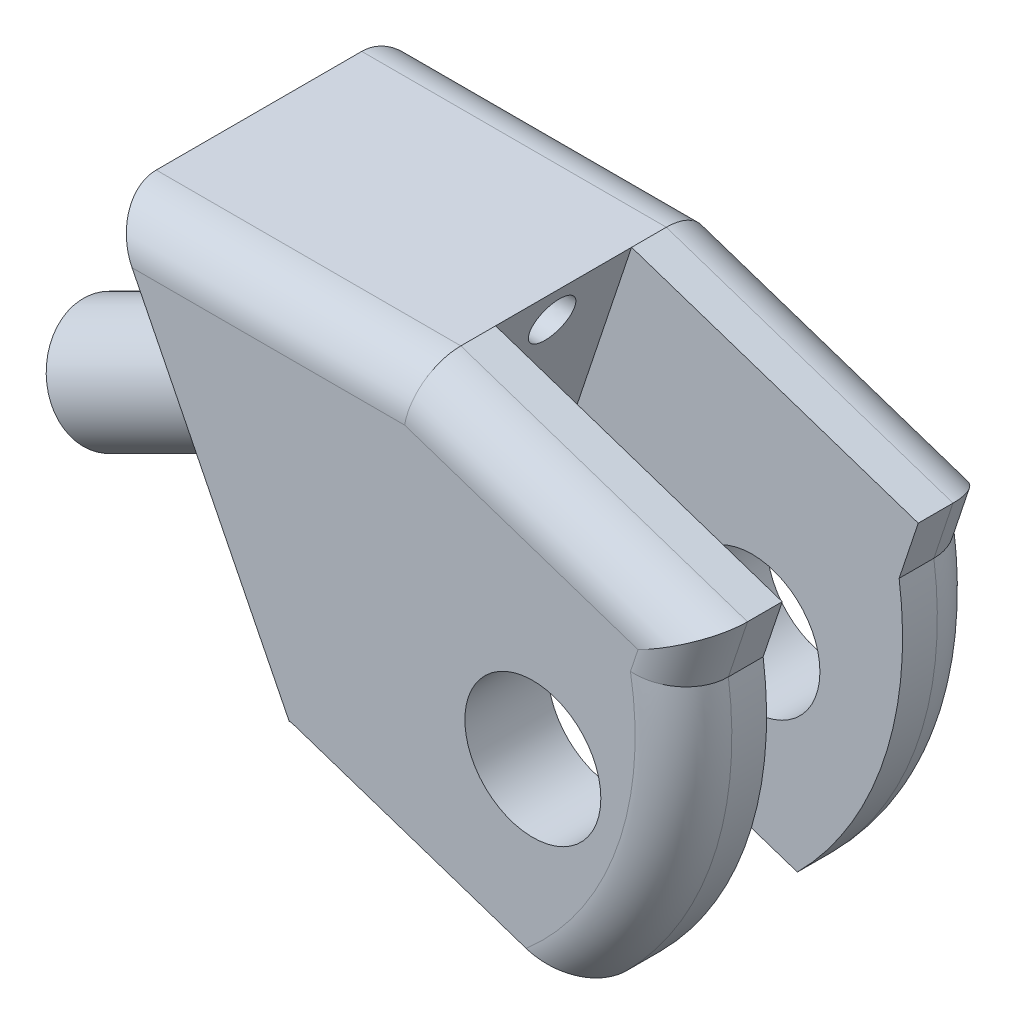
ISO-10303-21;
HEADER;
FILE_DESCRIPTION(('STEP AP214'),'2;1');
FILE_NAME('part.step','',(''),(''),'','','');
FILE_SCHEMA(('AUTOMOTIVE_DESIGN { 1 0 10303 214 1 1 1 1 }'));
ENDSEC;
DATA;
#1=APPLICATION_CONTEXT('core data for automotive mechanical design processes');
#2=APPLICATION_PROTOCOL_DEFINITION('international standard','automotive_design',2000,#1);
#3=PRODUCT_CONTEXT('',#1,'mechanical');
#4=PRODUCT('Part','Part','',(#3));
#5=PRODUCT_RELATED_PRODUCT_CATEGORY('part','',(#4));
#6=PRODUCT_DEFINITION_FORMATION('','',#4);
#7=PRODUCT_DEFINITION_CONTEXT('part definition',#1,'design');
#8=PRODUCT_DEFINITION('design','',#6,#7);
#9=PRODUCT_DEFINITION_SHAPE('','',#8);
#10=(LENGTH_UNIT() NAMED_UNIT(*) SI_UNIT(.MILLI.,.METRE.));
#11=(NAMED_UNIT(*) PLANE_ANGLE_UNIT() SI_UNIT($,.RADIAN.));
#12=(NAMED_UNIT(*) SI_UNIT($,.STERADIAN.) SOLID_ANGLE_UNIT());
#13=UNCERTAINTY_MEASURE_WITH_UNIT(LENGTH_MEASURE(1.E-05),#10,'distance_accuracy_value','');
#14=(GEOMETRIC_REPRESENTATION_CONTEXT(3) GLOBAL_UNCERTAINTY_ASSIGNED_CONTEXT((#13)) GLOBAL_UNIT_ASSIGNED_CONTEXT((#10,
#11,#12)) REPRESENTATION_CONTEXT('',''));
#15=CARTESIAN_POINT('',(0.,0.,0.));
#16=DIRECTION('',(0.,0.,1.));
#17=DIRECTION('',(1.,0.,0.));
#18=AXIS2_PLACEMENT_3D('',#15,#16,#17);
#19=CARTESIAN_POINT('',(16.002,19.05,-15.875));
#20=DIRECTION('',(-0.948683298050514,0.316227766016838,0.));
#21=DIRECTION('',(-0.316227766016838,-0.948683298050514,0.));
#22=AXIS2_PLACEMENT_3D('',#19,#20,#21);
#23=PLANE('',#22);
#24=DIRECTION('',(-0.316227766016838,-0.948683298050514,0.));
#25=VECTOR('',#24,1.);
#26=CARTESIAN_POINT('',(9.652,0.,-11.509375));
#27=LINE('',#26,#25);
#28=CARTESIAN_POINT('',(16.002,19.05,-11.509375));
#29=VERTEX_POINT('',#28);
#30=CARTESIAN_POINT('',(9.652,0.,-11.509375));
#31=VERTEX_POINT('',#30);
#32=EDGE_CURVE('E180',#29,#31,#27,.T.);
#33=ORIENTED_EDGE('',*,*,#32,.F.);
#34=DIRECTION('',(0.,0.,-1.));
#35=VECTOR('',#34,1.);
#36=CARTESIAN_POINT('',(16.002,19.05,0.));
#37=LINE('',#36,#35);
#38=CARTESIAN_POINT('',(16.002,19.05,-4.365625));
#39=VERTEX_POINT('',#38);
#40=EDGE_CURVE('E242',#39,#29,#37,.T.);
#41=ORIENTED_EDGE('',*,*,#40,.F.);
#42=DIRECTION('',(0.316227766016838,0.948683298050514,0.));
#43=VECTOR('',#42,1.);
#44=CARTESIAN_POINT('',(9.652,0.,-4.365625));
#45=LINE('',#44,#43);
#46=CARTESIAN_POINT('',(9.652,0.,-4.365625));
#47=VERTEX_POINT('',#46);
#48=EDGE_CURVE('E211',#47,#39,#45,.T.);
#49=ORIENTED_EDGE('',*,*,#48,.F.);
#50=DIRECTION('',(0.,0.,1.));
#51=VECTOR('',#50,1.);
#52=CARTESIAN_POINT('',(9.652,0.,-15.875));
#53=LINE('',#52,#51);
#54=EDGE_CURVE('E228',#31,#47,#53,.T.);
#55=ORIENTED_EDGE('',*,*,#54,.F.);
#56=EDGE_LOOP('',(#33,#41,#49,#55));
#57=FACE_BOUND('',#56,.T.);
#58=CARTESIAN_POINT('',(15.7760947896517,18.3722843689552,-7.9375));
#59=CARTESIAN_POINT('',(15.7760933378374,18.3722800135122,-7.87061328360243));
#60=CARTESIAN_POINT('',(15.7743040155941,18.3669120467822,-7.80365677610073));
#61=CARTESIAN_POINT('',(15.768980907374,18.3509427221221,-7.70471289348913));
#62=CARTESIAN_POINT('',(15.7667637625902,18.3442912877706,-7.6719536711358));
#63=CARTESIAN_POINT('',(15.7614633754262,18.3283901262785,-7.60710950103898));
#64=CARTESIAN_POINT('',(15.7583793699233,18.3191381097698,-7.57502517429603));
#65=CARTESIAN_POINT('',(15.7478665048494,18.2875995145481,-7.48026185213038));
#66=CARTESIAN_POINT('',(15.7391697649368,18.2615092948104,-7.41894265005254));
#67=CARTESIAN_POINT('',(15.7186402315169,18.1999206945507,-7.30179817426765));
#68=CARTESIAN_POINT('',(15.7068073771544,18.1644221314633,-7.24597300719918));
#69=CARTESIAN_POINT('',(15.6869734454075,18.1049203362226,-7.16756612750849));
#70=CARTESIAN_POINT('',(15.6800093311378,18.0840279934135,-7.14230385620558));
#71=CARTESIAN_POINT('',(15.6654406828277,18.0403220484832,-7.09374611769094));
#72=CARTESIAN_POINT('',(15.6578367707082,18.0175103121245,-7.07044878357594));
#73=CARTESIAN_POINT('',(15.6341269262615,17.9463807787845,-7.00371039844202));
#74=CARTESIAN_POINT('',(15.6171179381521,17.8953538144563,-6.96340344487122));
#75=CARTESIAN_POINT('',(15.5812104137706,17.7876312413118,-6.89241471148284));
#76=CARTESIAN_POINT('',(15.5623119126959,17.7309357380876,-6.86173275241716));
#77=CARTESIAN_POINT('',(15.5231519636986,17.6134558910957,-6.81083168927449));
#78=CARTESIAN_POINT('',(15.5028905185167,17.5526715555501,-6.79061256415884));
#79=CARTESIAN_POINT('',(15.4615823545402,17.4287470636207,-6.76121966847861));
#80=CARTESIAN_POINT('',(15.4405356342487,17.3656069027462,-6.75204591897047));
#81=CARTESIAN_POINT('',(15.3982537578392,17.2387612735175,-6.74500194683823));
#82=CARTESIAN_POINT('',(15.3770186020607,17.1750558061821,-6.74713170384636));
#83=CARTESIAN_POINT('',(15.3349627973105,17.0488883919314,-6.76263486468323));
#84=CARTESIAN_POINT('',(15.3141421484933,16.98642644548,-6.77600827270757));
#85=CARTESIAN_POINT('',(15.273506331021,16.8645189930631,-6.81361896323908));
#86=CARTESIAN_POINT('',(15.2536911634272,16.8050734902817,-6.83785625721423));
#87=CARTESIAN_POINT('',(15.2156288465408,16.6908865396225,-6.89650673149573));
#88=CARTESIAN_POINT('',(15.197381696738,16.6361450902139,-6.93091990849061));
#89=CARTESIAN_POINT('',(15.162973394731,16.5329201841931,-7.00894523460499));
#90=CARTESIAN_POINT('',(15.1468122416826,16.4844367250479,-7.05255738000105));
#91=CARTESIAN_POINT('',(15.1170346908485,16.3951040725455,-7.14774264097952));
#92=CARTESIAN_POINT('',(15.1034182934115,16.3542548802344,-7.1993157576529));
#93=CARTESIAN_POINT('',(15.0791167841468,16.2813503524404,-7.30895895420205));
#94=CARTESIAN_POINT('',(15.0684316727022,16.2492950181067,-7.36702903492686));
#95=CARTESIAN_POINT('',(15.0502960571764,16.1948881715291,-7.48801771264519));
#96=CARTESIAN_POINT('',(15.0428455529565,16.1725366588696,-7.55093630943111));
#97=CARTESIAN_POINT('',(15.03139064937,16.1381719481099,-7.67983594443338));
#98=CARTESIAN_POINT('',(15.0273862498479,16.1261587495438,-7.74581698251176));
#99=CARTESIAN_POINT('',(15.0229372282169,16.1128116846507,-7.87896849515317));
#100=CARTESIAN_POINT('',(15.0224926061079,16.1114778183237,-7.94613896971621));
#101=CARTESIAN_POINT('',(15.0251757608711,16.1195272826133,-8.07976258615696));
#102=CARTESIAN_POINT('',(15.0283035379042,16.1289106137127,-8.14621572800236));
#103=CARTESIAN_POINT('',(15.0380427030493,16.158128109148,-8.27651826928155));
#104=CARTESIAN_POINT('',(15.0446540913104,16.1779622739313,-8.34036766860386));
#105=CARTESIAN_POINT('',(15.0611727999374,16.2275183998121,-8.46365021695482));
#106=CARTESIAN_POINT('',(15.0710801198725,16.2572403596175,-8.5230833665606));
#107=CARTESIAN_POINT('',(15.0939094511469,16.3257283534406,-8.6358462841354));
#108=CARTESIAN_POINT('',(15.106831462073,16.3644943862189,-8.68917605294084));
#109=CARTESIAN_POINT('',(15.1353233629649,16.4499700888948,-8.78821836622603));
#110=CARTESIAN_POINT('',(15.1508932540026,16.4966797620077,-8.83393090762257));
#111=CARTESIAN_POINT('',(15.1842389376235,16.5967168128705,-8.91644109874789));
#112=CARTESIAN_POINT('',(15.2020147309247,16.650044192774,-8.95323874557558));
#113=CARTESIAN_POINT('',(15.2392675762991,16.7618027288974,-9.01687455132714));
#114=CARTESIAN_POINT('',(15.2587446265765,16.8202338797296,-9.04371272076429));
#115=CARTESIAN_POINT('',(15.2988471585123,16.9405414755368,-9.08666763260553));
#116=CARTESIAN_POINT('',(15.3194726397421,17.0024179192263,-9.10278437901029));
#117=CARTESIAN_POINT('',(15.3612863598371,17.1278590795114,-9.12383945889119));
#118=CARTESIAN_POINT('',(15.3824745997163,17.1914237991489,-9.12877777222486));
#119=CARTESIAN_POINT('',(15.4248131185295,17.3184393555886,-9.12733393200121));
#120=CARTESIAN_POINT('',(15.4459633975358,17.3818901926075,-9.12095180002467));
#121=CARTESIAN_POINT('',(15.4876225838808,17.5068677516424,-9.09705501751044));
#122=CARTESIAN_POINT('',(15.5081314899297,17.5683944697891,-9.07954034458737));
#123=CARTESIAN_POINT('',(15.5479376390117,17.687812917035,-9.03384999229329));
#124=CARTESIAN_POINT('',(15.5672348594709,17.7457045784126,-9.00567411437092));
#125=CARTESIAN_POINT('',(15.5948317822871,17.8284953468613,-8.95607897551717));
#126=CARTESIAN_POINT('',(15.6038074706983,17.8554224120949,-8.93832142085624));
#127=CARTESIAN_POINT('',(15.6212635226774,17.9077905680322,-8.90046416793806));
#128=CARTESIAN_POINT('',(15.6297434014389,17.9332302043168,-8.8803622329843));
#129=CARTESIAN_POINT('',(15.6543211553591,18.0069634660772,-8.81679473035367));
#130=CARTESIAN_POINT('',(15.6695821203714,18.0527463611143,-8.77002248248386));
#131=CARTESIAN_POINT('',(15.6974002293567,18.1362006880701,-8.66903251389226));
#132=CARTESIAN_POINT('',(15.7099574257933,18.1738722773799,-8.61481493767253));
#133=CARTESIAN_POINT('',(15.7265009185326,18.2235027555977,-8.52909201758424));
#134=CARTESIAN_POINT('',(15.7316372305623,18.2389116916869,-8.49975436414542));
#135=CARTESIAN_POINT('',(15.741106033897,18.267318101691,-8.43984505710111));
#136=CARTESIAN_POINT('',(15.7454392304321,18.2803176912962,-8.40927451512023));
#137=CARTESIAN_POINT('',(15.75718385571,18.3155515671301,-8.31603351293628));
#138=CARTESIAN_POINT('',(15.7633587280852,18.3340761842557,-8.25173809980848));
#139=CARTESIAN_POINT('',(15.7705438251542,18.3556314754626,-8.14545542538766));
#140=CARTESIAN_POINT('',(15.7726225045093,18.361867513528,-8.10414673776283));
#141=CARTESIAN_POINT('',(15.7753984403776,18.3701953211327,-8.02106778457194));
#142=CARTESIAN_POINT('',(15.7760956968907,18.3722870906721,-7.97929751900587));
#143=CARTESIAN_POINT('',(15.7760947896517,18.3722843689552,-7.9375));
#144=B_SPLINE_CURVE_WITH_KNOTS('',3,(#58,#59,#60,#61,#62,#63,#64,#65,#66,#67,#68,#69,#70,#71,
#72,#73,#74,#75,#76,#77,#78,#79,#80,#81,#82,#83,#84,#85,#86,#87,#88,#89,#90,#91,#92,#93,#94,#95,
#96,#97,#98,#99,#100,#101,#102,#103,#104,#105,#106,#107,#108,#109,#110,#111,#112,#113,#114,#115,
#116,#117,#118,#119,#120,#121,#122,#123,#124,#125,#126,#127,#128,#129,#130,#131,#132,#133,#134,
#135,#136,#137,#138,#139,#140,#141,#142,#143),.UNSPECIFIED.,.T.,.F.,(4,2,2,2,2,2,2,2,2,2,2,2,2,
2,2,2,2,2,2,2,2,2,2,2,2,2,2,2,2,2,2,2,2,2,2,2,2,2,2,2,2,2,4),(0.,0.200481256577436,
0.30088768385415,0.401382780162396,0.601982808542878,0.802586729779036,0.903023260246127,
1.00336326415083,1.20396917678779,1.40457135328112,1.60517312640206,1.805775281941,
2.00637707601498,2.20697894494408,2.40758102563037,2.60818304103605,2.80878497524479,
3.00938693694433,3.20998892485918,3.41059090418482,3.61119287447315,3.81179484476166,
4.01239682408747,4.21299881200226,4.41360077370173,4.61420270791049,4.81480472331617,
5.01540680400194,5.21600867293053,5.41661046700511,5.61721262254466,5.81781439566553,
6.0184165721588,6.21902248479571,6.3193624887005,6.41979901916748,6.62040294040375,
6.82100296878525,6.92149806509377,7.02190449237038,7.22238574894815,7.34766651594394,
7.47294728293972),.UNSPECIFIED.);
#145=CARTESIAN_POINT('',(15.7760947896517,18.3722843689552,-7.9375));
#146=VERTEX_POINT('',#145);
#147=EDGE_CURVE('E398',#146,#146,#144,.T.);
#148=ORIENTED_EDGE('',*,*,#147,.F.);
#149=EDGE_LOOP('',(#148));
#150=FACE_BOUND('',#149,.T.);
#151=CARTESIAN_POINT('',(10.6309225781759,2.93676773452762,-7.9375));
#152=CARTESIAN_POINT('',(10.6309211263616,2.93676337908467,-7.87061328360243));
#153=CARTESIAN_POINT('',(10.6291318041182,2.93139541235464,-7.80365677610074));
#154=CARTESIAN_POINT('',(10.6238086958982,2.91542608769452,-7.70471289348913));
#155=CARTESIAN_POINT('',(10.6215915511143,2.90877465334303,-7.67195367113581));
#156=CARTESIAN_POINT('',(10.6162911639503,2.89287349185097,-7.60710950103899));
#157=CARTESIAN_POINT('',(10.6132071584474,2.88362147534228,-7.57502517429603));
#158=CARTESIAN_POINT('',(10.6026942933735,2.85208288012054,-7.48026185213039));
#159=CARTESIAN_POINT('',(10.5939975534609,2.82599266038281,-7.41894265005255));
#160=CARTESIAN_POINT('',(10.5734680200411,2.76440406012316,-7.30179817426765));
#161=CARTESIAN_POINT('',(10.5616351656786,2.72890549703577,-7.24597300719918));
#162=CARTESIAN_POINT('',(10.5418012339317,2.66940370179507,-7.16756612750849));
#163=CARTESIAN_POINT('',(10.534837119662,2.64851135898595,-7.14230385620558));
#164=CARTESIAN_POINT('',(10.5202684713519,2.60480541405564,-7.09374611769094));
#165=CARTESIAN_POINT('',(10.5126645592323,2.58199367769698,-7.07044878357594));
#166=CARTESIAN_POINT('',(10.4889547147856,2.51086414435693,-7.00371039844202));
#167=CARTESIAN_POINT('',(10.4719457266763,2.45983718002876,-6.96340344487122));
#168=CARTESIAN_POINT('',(10.4360382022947,2.35211460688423,-6.89241471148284));
#169=CARTESIAN_POINT('',(10.41713970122,2.29541910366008,-6.86173275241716));
#170=CARTESIAN_POINT('',(10.3779797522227,2.17793925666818,-6.81083168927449));
#171=CARTESIAN_POINT('',(10.3577183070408,2.11715492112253,-6.79061256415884));
#172=CARTESIAN_POINT('',(10.3164101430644,1.99323042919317,-6.76121966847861));
#173=CARTESIAN_POINT('',(10.2953634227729,1.93009026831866,-6.75204591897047));
#174=CARTESIAN_POINT('',(10.2530815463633,1.80324463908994,-6.74500194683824));
#175=CARTESIAN_POINT('',(10.2318463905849,1.73953917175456,-6.74713170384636));
#176=CARTESIAN_POINT('',(10.1897905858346,1.61337175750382,-6.76263486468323));
#177=CARTESIAN_POINT('',(10.1689699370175,1.5509098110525,-6.77600827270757));
#178=CARTESIAN_POINT('',(10.1283341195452,1.42900235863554,-6.81361896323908));
#179=CARTESIAN_POINT('',(10.1085189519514,1.36955685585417,-6.83785625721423));
#180=CARTESIAN_POINT('',(10.070456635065,1.25536990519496,-6.89650673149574));
#181=CARTESIAN_POINT('',(10.0522094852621,1.20062845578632,-6.93091990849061));
#182=CARTESIAN_POINT('',(10.0178011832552,1.09740354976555,-7.00894523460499));
#183=CARTESIAN_POINT('',(10.0016400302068,1.04892009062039,-7.05255738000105));
#184=CARTESIAN_POINT('',(9.97186247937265,0.959587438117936,-7.14774264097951));
#185=CARTESIAN_POINT('',(9.95824608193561,0.918738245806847,-7.1993157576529));
#186=CARTESIAN_POINT('',(9.93394457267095,0.845833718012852,-7.30895895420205));
#187=CARTESIAN_POINT('',(9.92325946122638,0.813778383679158,-7.36702903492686));
#188=CARTESIAN_POINT('',(9.9051238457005,0.759371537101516,-7.48801771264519));
#189=CARTESIAN_POINT('',(9.89767334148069,0.737020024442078,-7.55093630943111));
#190=CARTESIAN_POINT('',(9.88621843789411,0.702655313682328,-7.67983594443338));
#191=CARTESIAN_POINT('',(9.88221403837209,0.690642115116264,-7.74581698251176));
#192=CARTESIAN_POINT('',(9.87776501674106,0.677295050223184,-7.87896849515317));
#193=CARTESIAN_POINT('',(9.87732039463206,0.675961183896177,-7.94613896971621));
#194=CARTESIAN_POINT('',(9.88000354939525,0.684010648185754,-8.07976258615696));
#195=CARTESIAN_POINT('',(9.88313132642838,0.693393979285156,-8.14621572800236));
#196=CARTESIAN_POINT('',(9.89287049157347,0.722611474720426,-8.27651826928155));
#197=CARTESIAN_POINT('',(9.89948187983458,0.742445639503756,-8.34036766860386));
#198=CARTESIAN_POINT('',(9.91600058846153,0.792001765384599,-8.46365021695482));
#199=CARTESIAN_POINT('',(9.92590790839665,0.821723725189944,-8.5230833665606));
#200=CARTESIAN_POINT('',(9.94873723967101,0.890211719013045,-8.63584628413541));
#201=CARTESIAN_POINT('',(9.96165925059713,0.928977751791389,-8.68917605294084));
#202=CARTESIAN_POINT('',(9.99015115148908,1.01445345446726,-8.78821836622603));
#203=CARTESIAN_POINT('',(10.0057210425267,1.06116312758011,-8.83393090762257));
#204=CARTESIAN_POINT('',(10.0390667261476,1.16120017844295,-8.91644109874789));
#205=CARTESIAN_POINT('',(10.0568425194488,1.21452755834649,-8.95323874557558));
#206=CARTESIAN_POINT('',(10.0940953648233,1.32628609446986,-9.01687455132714));
#207=CARTESIAN_POINT('',(10.1135724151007,1.38471724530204,-9.04371272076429));
#208=CARTESIAN_POINT('',(10.1536749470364,1.50502484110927,-9.08666763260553));
#209=CARTESIAN_POINT('',(10.1743004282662,1.56690128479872,-9.10278437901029));
#210=CARTESIAN_POINT('',(10.2161141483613,1.69234244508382,-9.12383945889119));
#211=CARTESIAN_POINT('',(10.2373023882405,1.75590716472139,-9.12877777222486));
#212=CARTESIAN_POINT('',(10.2796409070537,1.88292272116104,-9.12733393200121));
#213=CARTESIAN_POINT('',(10.30079118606,1.94637355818,-9.12095180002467));
#214=CARTESIAN_POINT('',(10.342450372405,2.07135111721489,-9.09705501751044));
#215=CARTESIAN_POINT('',(10.3629592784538,2.13287783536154,-9.07954034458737));
#216=CARTESIAN_POINT('',(10.4027654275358,2.25229628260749,-9.03384999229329));
#217=CARTESIAN_POINT('',(10.422062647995,2.31018794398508,-9.00567411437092));
#218=CARTESIAN_POINT('',(10.4496595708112,2.39297871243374,-8.95607897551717));
#219=CARTESIAN_POINT('',(10.4586352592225,2.41990577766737,-8.93832142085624));
#220=CARTESIAN_POINT('',(10.4760913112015,2.47227393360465,-8.90046416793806));
#221=CARTESIAN_POINT('',(10.4845711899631,2.49771356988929,-8.8803622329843));
#222=CARTESIAN_POINT('',(10.5091489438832,2.57144683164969,-8.81679473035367));
#223=CARTESIAN_POINT('',(10.5244099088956,2.61722972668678,-8.77002248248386));
#224=CARTESIAN_POINT('',(10.5522280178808,2.70068405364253,-8.66903251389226));
#225=CARTESIAN_POINT('',(10.5647852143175,2.73835564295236,-8.61481493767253));
#226=CARTESIAN_POINT('',(10.5813287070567,2.78798612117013,-8.52909201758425));
#227=CARTESIAN_POINT('',(10.5864650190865,2.80339505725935,-8.49975436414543));
#228=CARTESIAN_POINT('',(10.5959338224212,2.83180146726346,-8.43984505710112));
#229=CARTESIAN_POINT('',(10.6002670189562,2.84480105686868,-8.40927451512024));
#230=CARTESIAN_POINT('',(10.6120116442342,2.88003493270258,-8.31603351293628));
#231=CARTESIAN_POINT('',(10.6181865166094,2.89855954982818,-8.25173809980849));
#232=CARTESIAN_POINT('',(10.6253716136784,2.92011484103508,-8.14545542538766));
#233=CARTESIAN_POINT('',(10.6274502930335,2.92635087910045,-8.10414673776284));
#234=CARTESIAN_POINT('',(10.6302262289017,2.93467868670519,-8.02106778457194));
#235=CARTESIAN_POINT('',(10.6309234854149,2.93677045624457,-7.97929751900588));
#236=CARTESIAN_POINT('',(10.6309225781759,2.93676773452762,-7.9375));
#237=B_SPLINE_CURVE_WITH_KNOTS('',3,(#151,#152,#153,#154,#155,#156,#157,#158,#159,#160,#161,
#162,#163,#164,#165,#166,#167,#168,#169,#170,#171,#172,#173,#174,#175,#176,#177,#178,#179,#180,
#181,#182,#183,#184,#185,#186,#187,#188,#189,#190,#191,#192,#193,#194,#195,#196,#197,#198,#199,
#200,#201,#202,#203,#204,#205,#206,#207,#208,#209,#210,#211,#212,#213,#214,#215,#216,#217,#218,
#219,#220,#221,#222,#223,#224,#225,#226,#227,#228,#229,#230,#231,#232,#233,#234,#235,#236),
.UNSPECIFIED.,.T.,.F.,(4,2,2,2,2,2,2,2,2,2,2,2,2,2,2,2,2,2,2,2,2,2,2,2,2,2,2,2,2,2,2,2,2,2,2,2,
2,2,2,2,2,2,4),(0.,0.200481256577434,0.300887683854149,0.401382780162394,0.601982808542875,
0.802586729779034,0.903023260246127,1.00336326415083,1.2039691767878,1.40457135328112,
1.60517312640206,1.805775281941,2.00637707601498,2.20697894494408,2.40758102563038,
2.60818304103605,2.80878497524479,3.00938693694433,3.20998892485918,3.41059090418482,
3.61119287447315,3.81179484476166,4.01239682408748,4.21299881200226,4.41360077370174,
4.61420270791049,4.81480472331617,5.01540680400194,5.21600867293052,5.41661046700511,
5.61721262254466,5.81781439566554,6.0184165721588,6.21902248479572,6.31936248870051,
6.41979901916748,6.62040294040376,6.82100296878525,6.92149806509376,7.02190449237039,
7.22238574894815,7.34766651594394,7.47294728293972),.UNSPECIFIED.);
#238=CARTESIAN_POINT('',(10.6309225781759,2.93676773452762,-7.9375));
#239=VERTEX_POINT('',#238);
#240=EDGE_CURVE('E401',#239,#239,#237,.T.);
#241=ORIENTED_EDGE('',*,*,#240,.F.);
#242=EDGE_LOOP('',(#241));
#243=FACE_BOUND('',#242,.T.);
#244=ADVANCED_FACE('F36',(#57,#150,#243),#23,.F.);
#245=CARTESIAN_POINT('',(9.525,0.,-15.875));
#246=DIRECTION('',(0.894427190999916,0.447213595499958,0.));
#247=DIRECTION('',(-0.447213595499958,0.894427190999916,0.));
#248=AXIS2_PLACEMENT_3D('',#245,#246,#247);
#249=PLANE('',#248);
#250=CARTESIAN_POINT('',(4.7625,9.525,-7.9375));
#251=DIRECTION('',(-0.894427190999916,-0.447213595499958,0.));
#252=DIRECTION('',(0.447213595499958,-0.894427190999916,0.));
#253=AXIS2_PLACEMENT_3D('',#250,#251,#252);
#254=CIRCLE('',#253,3.01625);
#255=CARTESIAN_POINT('',(6.11140800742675,6.82718398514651,-7.9375));
#256=VERTEX_POINT('',#255);
#257=EDGE_CURVE('E11',#256,#256,#254,.T.);
#258=ORIENTED_EDGE('',*,*,#257,.F.);
#259=EDGE_LOOP('',(#258));
#260=FACE_BOUND('',#259,.T.);
#261=DIRECTION('',(0.,0.,1.));
#262=VECTOR('',#261,1.);
#263=CARTESIAN_POINT('',(0.,19.05,0.));
#264=LINE('',#263,#262);
#265=CARTESIAN_POINT('',(0.,19.05,-13.335));
#266=VERTEX_POINT('',#265);
#267=CARTESIAN_POINT('',(0.,19.05,-2.54));
#268=VERTEX_POINT('',#267);
#269=EDGE_CURVE('E240',#266,#268,#264,.T.);
#270=ORIENTED_EDGE('',*,*,#269,.F.);
#271=CARTESIAN_POINT('',(1.27,16.51,-13.335));
#272=DIRECTION('',(0.894427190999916,0.447213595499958,0.));
#273=DIRECTION('',(-0.447213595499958,0.894427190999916,0.));
#274=AXIS2_PLACEMENT_3D('',#271,#272,#273);
#275=ELLIPSE('',#274,2.83980633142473,2.54);
#276=CARTESIAN_POINT('',(1.27,16.51,-15.875));
#277=VERTEX_POINT('',#276);
#278=EDGE_CURVE('E474',#266,#277,#275,.F.);
#279=ORIENTED_EDGE('',*,*,#278,.T.);
#280=DIRECTION('',(-0.447213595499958,0.894427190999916,0.));
#281=VECTOR('',#280,1.);
#282=CARTESIAN_POINT('',(9.525,0.,-15.875));
#283=LINE('',#282,#281);
#284=CARTESIAN_POINT('',(9.525,0.,-15.875));
#285=VERTEX_POINT('',#284);
#286=EDGE_CURVE('E233',#285,#277,#283,.T.);
#287=ORIENTED_EDGE('',*,*,#286,.F.);
#288=DIRECTION('',(0.,0.,1.));
#289=VECTOR('',#288,1.);
#290=CARTESIAN_POINT('',(9.525,0.,-15.875));
#291=LINE('',#290,#289);
#292=CARTESIAN_POINT('',(9.525,0.,0.));
#293=VERTEX_POINT('',#292);
#294=EDGE_CURVE('E236',#285,#293,#291,.T.);
#295=ORIENTED_EDGE('',*,*,#294,.T.);
#296=DIRECTION('',(-0.447213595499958,0.894427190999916,0.));
#297=VECTOR('',#296,1.);
#298=CARTESIAN_POINT('',(9.525,0.,0.));
#299=LINE('',#298,#297);
#300=CARTESIAN_POINT('',(1.27,16.51,0.));
#301=VERTEX_POINT('',#300);
#302=EDGE_CURVE('E232',#293,#301,#299,.T.);
#303=ORIENTED_EDGE('',*,*,#302,.T.);
#304=CARTESIAN_POINT('',(1.27,16.51,-2.54));
#305=DIRECTION('',(0.894427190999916,0.447213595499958,0.));
#306=DIRECTION('',(0.447213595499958,-0.894427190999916,0.));
#307=AXIS2_PLACEMENT_3D('',#304,#305,#306);
#308=ELLIPSE('',#307,2.83980633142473,2.54);
#309=EDGE_CURVE('E61',#301,#268,#308,.F.);
#310=ORIENTED_EDGE('',*,*,#309,.T.);
#311=EDGE_LOOP('',(#270,#279,#287,#295,#303,#310));
#312=FACE_BOUND('',#311,.T.);
#313=CARTESIAN_POINT('',(0.338857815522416,18.3722843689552,-7.9375));
#314=CARTESIAN_POINT('',(0.338857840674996,18.37228431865,-7.96902730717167));
#315=CARTESIAN_POINT('',(0.339452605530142,18.3710947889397,-8.00055299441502));
#316=CARTESIAN_POINT('',(0.341823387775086,18.3663532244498,-8.06336635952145));
#317=CARTESIAN_POINT('',(0.343599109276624,18.3628017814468,-8.09465409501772));
#318=CARTESIAN_POINT('',(0.350731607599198,18.3485367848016,-8.18853023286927));
#319=CARTESIAN_POINT('',(0.357893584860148,18.3342128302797,-8.25048169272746));
#320=CARTESIAN_POINT('',(0.376743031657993,18.296513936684,-8.37090957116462));
#321=CARTESIAN_POINT('',(0.388438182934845,18.2731236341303,-8.42937989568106));
#322=CARTESIAN_POINT('',(0.416028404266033,18.2179431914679,-8.54161531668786));
#323=CARTESIAN_POINT('',(0.431949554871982,18.186100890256,-8.59534833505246));
#324=CARTESIAN_POINT('',(0.467437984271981,18.115124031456,-8.69642414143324));
#325=CARTESIAN_POINT('',(0.487006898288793,18.0759862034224,-8.74376404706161));
#326=CARTESIAN_POINT('',(0.530173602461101,17.9896527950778,-8.83304447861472));
#327=CARTESIAN_POINT('',(0.553915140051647,17.9421697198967,-8.87463721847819));
#328=CARTESIAN_POINT('',(0.604046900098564,17.8419061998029,-8.94888364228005));
#329=CARTESIAN_POINT('',(0.630437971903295,17.7891240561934,-8.98153444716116));
#330=CARTESIAN_POINT('',(0.68669822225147,17.6766035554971,-9.03887787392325));
#331=CARTESIAN_POINT('',(0.716679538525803,17.6166409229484,-9.06301960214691));
#332=CARTESIAN_POINT('',(0.778000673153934,17.4939986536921,-9.10024459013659));
#333=CARTESIAN_POINT('',(0.809340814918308,17.4313183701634,-9.11332520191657));
#334=CARTESIAN_POINT('',(0.857431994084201,17.3351360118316,-9.12465442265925));
#335=CARTESIAN_POINT('',(0.874009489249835,17.3019810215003,-9.12700194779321));
#336=CARTESIAN_POINT('',(0.907178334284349,17.2356433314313,-9.12861449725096));
#337=CARTESIAN_POINT('',(0.923769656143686,17.2024606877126,-9.1278824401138));
#338=CARTESIAN_POINT('',(0.973432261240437,17.1031354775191,-9.12105925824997));
#339=CARTESIAN_POINT('',(1.00640050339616,17.0371989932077,-9.11034306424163));
#340=CARTESIAN_POINT('',(1.07149518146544,16.9070096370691,-9.07653519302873));
#341=CARTESIAN_POINT('',(1.10360452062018,16.8427909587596,-9.0532803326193));
#342=CARTESIAN_POINT('',(1.16556127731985,16.7188774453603,-8.99474133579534));
#343=CARTESIAN_POINT('',(1.19540886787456,16.6591822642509,-8.95945812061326));
#344=CARTESIAN_POINT('',(1.25113264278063,16.5477347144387,-8.87867494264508));
#345=CARTESIAN_POINT('',(1.27709025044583,16.4958194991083,-8.83345630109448));
#346=CARTESIAN_POINT('',(1.32499965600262,16.4000006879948,-8.73341367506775));
#347=CARTESIAN_POINT('',(1.34695275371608,16.3560944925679,-8.67859281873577));
#348=CARTESIAN_POINT('',(1.38494673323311,16.2801065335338,-8.56403341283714));
#349=CARTESIAN_POINT('',(1.40124147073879,16.2475170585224,-8.50471604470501));
#350=CARTESIAN_POINT('',(1.42883659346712,16.1923268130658,-8.38053109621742));
#351=CARTESIAN_POINT('',(1.44013889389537,16.1697222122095,-8.31566565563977));
#352=CARTESIAN_POINT('',(1.45679365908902,16.1364126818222,-8.18616489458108));
#353=CARTESIAN_POINT('',(1.46244441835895,16.1251111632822,-8.12172092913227));
#354=CARTESIAN_POINT('',(1.46865110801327,16.1126977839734,-7.99162186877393));
#355=CARTESIAN_POINT('',(1.469208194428,16.111583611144,-7.92596705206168));
#356=CARTESIAN_POINT('',(1.46527123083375,16.1194575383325,-7.79752041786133));
#357=CARTESIAN_POINT('',(1.46093657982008,16.1281268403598,-7.7347037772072));
#358=CARTESIAN_POINT('',(1.44763701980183,16.1547259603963,-7.61157823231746));
#359=CARTESIAN_POINT('',(1.43867218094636,16.1726556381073,-7.55126929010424));
#360=CARTESIAN_POINT('',(1.41637141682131,16.2172571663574,-7.43443565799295));
#361=CARTESIAN_POINT('',(1.40301047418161,16.2439790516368,-7.37793491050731));
#362=CARTESIAN_POINT('',(1.37238739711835,16.3052252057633,-7.27050223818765));
#363=CARTESIAN_POINT('',(1.35512467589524,16.3397506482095,-7.21957115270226));
#364=CARTESIAN_POINT('',(1.3164995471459,16.4170009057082,-7.12256917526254));
#365=CARTESIAN_POINT('',(1.29500406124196,16.4599918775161,-7.07676352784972));
#366=CARTESIAN_POINT('',(1.24903775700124,16.5519244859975,-6.99336077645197));
#367=CARTESIAN_POINT('',(1.22456620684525,16.6008675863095,-6.95576569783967));
#368=CARTESIAN_POINT('',(1.17189621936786,16.7062075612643,-6.88764953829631));
#369=CARTESIAN_POINT('',(1.14356637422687,16.7628672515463,-6.85763624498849));
#370=CARTESIAN_POINT('',(1.08513417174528,16.8797316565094,-6.80808883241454));
#371=CARTESIAN_POINT('',(1.05503135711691,16.9399372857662,-6.78855742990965));
#372=CARTESIAN_POINT('',(0.992270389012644,17.0654592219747,-6.75959195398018));
#373=CARTESIAN_POINT('',(0.959559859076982,17.130880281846,-6.75071504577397));
#374=CARTESIAN_POINT('',(0.910376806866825,17.2292463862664,-6.74645604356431));
#375=CARTESIAN_POINT('',(0.893958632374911,17.2620827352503,-6.74654697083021));
#376=CARTESIAN_POINT('',(0.86116401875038,17.3276719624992,-6.74973936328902));
#377=CARTESIAN_POINT('',(0.844787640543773,17.3604247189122,-6.75284394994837));
#378=CARTESIAN_POINT('',(0.795142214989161,17.4597155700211,-6.76689725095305));
#379=CARTESIAN_POINT('',(0.76211801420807,17.5257639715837,-6.782653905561));
#380=CARTESIAN_POINT('',(0.697770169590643,17.6544596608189,-6.82648874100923));
#381=CARTESIAN_POINT('',(0.666446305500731,17.7171073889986,-6.85456532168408));
#382=CARTESIAN_POINT('',(0.606844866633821,17.8363102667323,-6.92204773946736));
#383=CARTESIAN_POINT('',(0.578531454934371,17.8929370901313,-6.96129319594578));
#384=CARTESIAN_POINT('',(0.538753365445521,17.972493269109,-7.02800184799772));
#385=CARTESIAN_POINT('',(0.525943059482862,17.9981138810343,-7.05154388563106));
#386=CARTESIAN_POINT('',(0.501301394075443,18.0473972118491,-7.10114058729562));
#387=CARTESIAN_POINT('',(0.48947144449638,18.0710571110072,-7.12719875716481));
#388=CARTESIAN_POINT('',(0.4567413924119,18.1365172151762,-7.20623424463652));
#389=CARTESIAN_POINT('',(0.437290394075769,18.1754192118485,-7.2622826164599));
#390=CARTESIAN_POINT('',(0.403194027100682,18.2436119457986,-7.38126025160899));
#391=CARTESIAN_POINT('',(0.388546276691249,18.2729074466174,-7.44418608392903));
#392=CARTESIAN_POINT('',(0.37040787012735,18.3091842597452,-7.54343379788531));
#393=CARTESIAN_POINT('',(0.364938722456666,18.3201225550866,-7.57800340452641));
#394=CARTESIAN_POINT('',(0.355517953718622,18.3389640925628,-7.64814306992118));
#395=CARTESIAN_POINT('',(0.351565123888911,18.3468697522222,-7.68371230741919));
#396=CARTESIAN_POINT('',(0.345228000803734,18.3595439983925,-7.75548395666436));
#397=CARTESIAN_POINT('',(0.342841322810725,18.3643173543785,-7.79168531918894));
#398=CARTESIAN_POINT('',(0.339656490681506,18.370687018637,-7.86442526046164));
#399=CARTESIAN_POINT('',(0.338857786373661,18.3722844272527,-7.90096371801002));
#400=CARTESIAN_POINT('',(0.338857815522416,18.3722843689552,-7.9375));
#401=B_SPLINE_CURVE_WITH_KNOTS('',3,(#313,#314,#315,#316,#317,#318,#319,#320,#321,#322,#323,
#324,#325,#326,#327,#328,#329,#330,#331,#332,#333,#334,#335,#336,#337,#338,#339,#340,#341,#342,
#343,#344,#345,#346,#347,#348,#349,#350,#351,#352,#353,#354,#355,#356,#357,#358,#359,#360,#361,
#362,#363,#364,#365,#366,#367,#368,#369,#370,#371,#372,#373,#374,#375,#376,#377,#378,#379,#380,
#381,#382,#383,#384,#385,#386,#387,#388,#389,#390,#391,#392,#393,#394,#395,#396,#397,#398,#399,
#400),.UNSPECIFIED.,.T.,.F.,(4,2,2,2,2,2,2,2,2,2,2,2,2,2,2,2,2,2,2,2,2,2,2,2,2,2,2,2,2,2,2,2,2,
2,2,2,2,2,2,2,2,2,2,4),(0.,0.0945474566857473,0.18907123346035,0.380043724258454,
0.57134125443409,0.763847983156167,0.956441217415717,1.15787879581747,1.35938115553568,
1.57221692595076,1.78510363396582,1.89641899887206,2.00762889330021,2.22999326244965,
2.45532399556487,2.68063747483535,2.90024577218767,3.11978265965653,3.32755043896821,
3.53523844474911,3.73127162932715,3.92726032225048,4.11704251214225,4.30682182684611,
4.49770037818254,4.68860765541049,4.88692203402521,5.08528527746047,5.29464671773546,
5.50406239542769,5.72400913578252,5.83403969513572,5.94418434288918,6.16952076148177,
6.39482792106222,6.61705023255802,6.72815390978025,6.83941469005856,7.0510824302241,
7.2626450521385,7.37250724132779,7.48228166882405,7.59188855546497,7.70145746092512),.UNSPECIFIED.);
#402=CARTESIAN_POINT('',(0.338857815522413,18.3722843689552,-7.9375));
#403=VERTEX_POINT('',#402);
#404=EDGE_CURVE('E453',#403,#403,#401,.T.);
#405=ORIENTED_EDGE('',*,*,#404,.F.);
#406=EDGE_LOOP('',(#405));
#407=FACE_BOUND('',#406,.T.);
#408=CARTESIAN_POINT('',(8.05661613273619,2.93676773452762,-7.9375));
#409=CARTESIAN_POINT('',(8.05661615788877,2.93676768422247,-7.96902730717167));
#410=CARTESIAN_POINT('',(8.05721092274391,2.93557815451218,-8.00055299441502));
#411=CARTESIAN_POINT('',(8.05958170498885,2.93083659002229,-8.06336635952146));
#412=CARTESIAN_POINT('',(8.06135742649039,2.92728514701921,-8.09465409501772));
#413=CARTESIAN_POINT('',(8.06848992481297,2.91302015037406,-8.18853023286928));
#414=CARTESIAN_POINT('',(8.07565190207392,2.89869619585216,-8.25048169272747));
#415=CARTESIAN_POINT('',(8.09450134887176,2.86099730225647,-8.37090957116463));
#416=CARTESIAN_POINT('',(8.10619650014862,2.83760699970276,-8.42937989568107));
#417=CARTESIAN_POINT('',(8.1337867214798,2.78242655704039,-8.54161531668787));
#418=CARTESIAN_POINT('',(8.14970787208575,2.75058425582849,-8.59534833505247));
#419=CARTESIAN_POINT('',(8.18519630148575,2.67960739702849,-8.69642414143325));
#420=CARTESIAN_POINT('',(8.20476521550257,2.64046956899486,-8.74376404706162));
#421=CARTESIAN_POINT('',(8.24793191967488,2.55413616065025,-8.83304447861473));
#422=CARTESIAN_POINT('',(8.27167345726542,2.50665308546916,-8.8746372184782));
#423=CARTESIAN_POINT('',(8.32180521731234,2.40638956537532,-8.94888364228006));
#424=CARTESIAN_POINT('',(8.34819628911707,2.35360742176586,-8.98153444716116));
#425=CARTESIAN_POINT('',(8.40445653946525,2.24108692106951,-9.03887787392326));
#426=CARTESIAN_POINT('',(8.43443785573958,2.18112428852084,-9.06301960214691));
#427=CARTESIAN_POINT('',(8.49575899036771,2.05848201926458,-9.10024459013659));
#428=CARTESIAN_POINT('',(8.52709913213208,1.99580173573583,-9.11332520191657));
#429=CARTESIAN_POINT('',(8.57519031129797,1.89961937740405,-9.12465442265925));
#430=CARTESIAN_POINT('',(8.59176780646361,1.86646438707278,-9.12700194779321));
#431=CARTESIAN_POINT('',(8.62493665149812,1.80012669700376,-9.12861449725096));
#432=CARTESIAN_POINT('',(8.64152797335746,1.76694405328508,-9.1278824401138));
#433=CARTESIAN_POINT('',(8.69119057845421,1.66761884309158,-9.12105925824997));
#434=CARTESIAN_POINT('',(8.72415882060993,1.60168235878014,-9.11034306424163));
#435=CARTESIAN_POINT('',(8.78925349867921,1.47149300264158,-9.07653519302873));
#436=CARTESIAN_POINT('',(8.82136283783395,1.40727432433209,-9.05328033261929));
#437=CARTESIAN_POINT('',(8.88331959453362,1.28336081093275,-8.99474133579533));
#438=CARTESIAN_POINT('',(8.91316718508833,1.22366562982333,-8.95945812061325));
#439=CARTESIAN_POINT('',(8.9688909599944,1.11221808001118,-8.87867494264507));
#440=CARTESIAN_POINT('',(8.9948485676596,1.06030286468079,-8.83345630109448));
#441=CARTESIAN_POINT('',(9.0427579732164,0.96448405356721,-8.73341367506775));
#442=CARTESIAN_POINT('',(9.06471107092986,0.920577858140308,-8.67859281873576));
#443=CARTESIAN_POINT('',(9.10270505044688,0.844589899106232,-8.56403341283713));
#444=CARTESIAN_POINT('',(9.11899978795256,0.812000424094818,-8.504716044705));
#445=CARTESIAN_POINT('',(9.14659491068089,0.756810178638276,-8.38053109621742));
#446=CARTESIAN_POINT('',(9.15789721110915,0.734205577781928,-8.31566565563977));
#447=CARTESIAN_POINT('',(9.1745519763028,0.700896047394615,-8.18616489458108));
#448=CARTESIAN_POINT('',(9.18020273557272,0.689594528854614,-8.12172092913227));
#449=CARTESIAN_POINT('',(9.18640942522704,0.677181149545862,-7.99162186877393));
#450=CARTESIAN_POINT('',(9.18696651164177,0.676066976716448,-7.92596705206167));
#451=CARTESIAN_POINT('',(9.18302954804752,0.683940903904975,-7.79752041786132));
#452=CARTESIAN_POINT('',(9.17869489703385,0.692610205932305,-7.73470377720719));
#453=CARTESIAN_POINT('',(9.1653953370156,0.719209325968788,-7.61157823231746));
#454=CARTESIAN_POINT('',(9.15643049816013,0.737139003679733,-7.55126929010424));
#455=CARTESIAN_POINT('',(9.13412973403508,0.781740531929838,-7.43443565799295));
#456=CARTESIAN_POINT('',(9.12076879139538,0.808462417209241,-7.37793491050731));
#457=CARTESIAN_POINT('',(9.09014571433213,0.869708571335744,-7.27050223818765));
#458=CARTESIAN_POINT('',(9.072882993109,0.904234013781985,-7.21957115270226));
#459=CARTESIAN_POINT('',(9.03425786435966,0.981484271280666,-7.12256917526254));
#460=CARTESIAN_POINT('',(9.01276237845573,1.02447524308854,-7.07676352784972));
#461=CARTESIAN_POINT('',(8.96679607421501,1.11640785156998,-6.99336077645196));
#462=CARTESIAN_POINT('',(8.94232452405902,1.16535095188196,-6.95576569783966));
#463=CARTESIAN_POINT('',(8.88965453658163,1.27069092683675,-6.8876495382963));
#464=CARTESIAN_POINT('',(8.86132469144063,1.32735061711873,-6.85763624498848));
#465=CARTESIAN_POINT('',(8.80289248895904,1.44421502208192,-6.80808883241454));
#466=CARTESIAN_POINT('',(8.77278967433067,1.50442065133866,-6.78855742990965));
#467=CARTESIAN_POINT('',(8.7100287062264,1.62994258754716,-6.75959195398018));
#468=CARTESIAN_POINT('',(8.67731817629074,1.69536364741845,-6.75071504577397));
#469=CARTESIAN_POINT('',(8.62813512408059,1.79372975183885,-6.74645604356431));
#470=CARTESIAN_POINT('',(8.61171694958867,1.82656610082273,-6.74654697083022));
#471=CARTESIAN_POINT('',(8.57892233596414,1.89215532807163,-6.74973936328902));
#472=CARTESIAN_POINT('',(8.56254595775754,1.92490808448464,-6.75284394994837));
#473=CARTESIAN_POINT('',(8.51290053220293,2.02419893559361,-6.76689725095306));
#474=CARTESIAN_POINT('',(8.47987633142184,2.09024733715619,-6.78265390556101));
#475=CARTESIAN_POINT('',(8.41552848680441,2.21894302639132,-6.82648874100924));
#476=CARTESIAN_POINT('',(8.3842046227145,2.28159075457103,-6.85456532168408));
#477=CARTESIAN_POINT('',(8.32460318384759,2.40079363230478,-6.92204773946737));
#478=CARTESIAN_POINT('',(8.29628977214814,2.45742045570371,-6.96129319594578));
#479=CARTESIAN_POINT('',(8.25651168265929,2.53697663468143,-7.02800184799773));
#480=CARTESIAN_POINT('',(8.24370137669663,2.56259724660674,-7.05154388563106));
#481=CARTESIAN_POINT('',(8.21905971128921,2.61188057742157,-7.10114058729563));
#482=CARTESIAN_POINT('',(8.20722976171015,2.6355404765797,-7.12719875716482));
#483=CARTESIAN_POINT('',(8.17449970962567,2.70100058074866,-7.20623424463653));
#484=CARTESIAN_POINT('',(8.15504871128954,2.73990257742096,-7.26228261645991));
#485=CARTESIAN_POINT('',(8.12095234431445,2.80809531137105,-7.381260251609));
#486=CARTESIAN_POINT('',(8.10630459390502,2.83739081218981,-7.44418608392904));
#487=CARTESIAN_POINT('',(8.08816618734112,2.87366762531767,-7.54343379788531));
#488=CARTESIAN_POINT('',(8.08269703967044,2.8846059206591,-7.57800340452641));
#489=CARTESIAN_POINT('',(8.07327627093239,2.90344745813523,-7.64814306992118));
#490=CARTESIAN_POINT('',(8.06932344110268,2.91135311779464,-7.68371230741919));
#491=CARTESIAN_POINT('',(8.06298631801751,2.92402736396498,-7.75548395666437));
#492=CARTESIAN_POINT('',(8.0605996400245,2.928800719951,-7.79168531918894));
#493=CARTESIAN_POINT('',(8.05741480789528,2.93517038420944,-7.86442526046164));
#494=CARTESIAN_POINT('',(8.05661610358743,2.93676779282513,-7.90096371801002));
#495=CARTESIAN_POINT('',(8.05661613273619,2.93676773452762,-7.9375));
#496=B_SPLINE_CURVE_WITH_KNOTS('',3,(#408,#409,#410,#411,#412,#413,#414,#415,#416,#417,#418,
#419,#420,#421,#422,#423,#424,#425,#426,#427,#428,#429,#430,#431,#432,#433,#434,#435,#436,#437,
#438,#439,#440,#441,#442,#443,#444,#445,#446,#447,#448,#449,#450,#451,#452,#453,#454,#455,#456,
#457,#458,#459,#460,#461,#462,#463,#464,#465,#466,#467,#468,#469,#470,#471,#472,#473,#474,#475,
#476,#477,#478,#479,#480,#481,#482,#483,#484,#485,#486,#487,#488,#489,#490,#491,#492,#493,#494,
#495),.UNSPECIFIED.,.T.,.F.,(4,2,2,2,2,2,2,2,2,2,2,2,2,2,2,2,2,2,2,2,2,2,2,2,2,2,2,2,2,2,2,2,2,
2,2,2,2,2,2,2,2,2,2,4),(0.,0.0945474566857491,0.18907123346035,0.380043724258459,
0.571341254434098,0.763847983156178,0.956441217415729,1.15787879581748,1.35938115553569,
1.57221692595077,1.78510363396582,1.89641899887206,2.00762889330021,2.22999326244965,
2.45532399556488,2.68063747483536,2.90024577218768,3.11978265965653,3.32755043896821,
3.53523844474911,3.73127162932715,3.92726032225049,4.11704251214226,4.30682182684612,
4.49770037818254,4.68860765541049,4.88692203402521,5.08528527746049,5.29464671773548,
5.50406239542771,5.72400913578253,5.83403969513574,5.9441843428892,6.16952076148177,
6.39482792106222,6.61705023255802,6.72815390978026,6.83941469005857,7.05108243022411,
7.26264505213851,7.37250724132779,7.48228166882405,7.59188855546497,7.70145746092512),.UNSPECIFIED.);
#497=CARTESIAN_POINT('',(8.05661613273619,2.93676773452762,-7.9375));
#498=VERTEX_POINT('',#497);
#499=EDGE_CURVE('E403',#498,#498,#496,.T.);
#500=ORIENTED_EDGE('',*,*,#499,.F.);
#501=EDGE_LOOP('',(#500));
#502=FACE_BOUND('',#501,.T.);
#503=ADVANCED_FACE('F385',(#260,#312,#407,#502),#249,.F.);
#504=CARTESIAN_POINT('',(0.,19.05,0.));
#505=DIRECTION('',(0.,0.,-1.));
#506=DIRECTION('',(-1.,0.,0.));
#507=AXIS2_PLACEMENT_3D('',#504,#505,#506);
#508=PLANE('',#507);
#509=CARTESIAN_POINT('',(22.3250590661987,4.68560838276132,0.));
#510=DIRECTION('',(0.,0.,1.));
#511=DIRECTION('',(1.,0.,0.));
#512=AXIS2_PLACEMENT_3D('',#509,#510,#511);
#513=CIRCLE('',#512,3.57187499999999);
#514=CARTESIAN_POINT('',(25.8969340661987,4.68560838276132,0.));
#515=VERTEX_POINT('',#514);
#516=EDGE_CURVE('E463',#515,#515,#513,.T.);
#517=ORIENTED_EDGE('',*,*,#516,.F.);
#518=EDGE_LOOP('',(#517));
#519=FACE_BOUND('',#518,.T.);
#520=DIRECTION('',(-0.948683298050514,0.316227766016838,0.));
#521=VECTOR('',#520,1.);
#522=CARTESIAN_POINT('',(24.7123473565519,-5.0201157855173,0.));
#523=LINE('',#522,#521);
#524=CARTESIAN_POINT('',(21.9707117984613,-4.10623726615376,0.));
#525=VERTEX_POINT('',#524);
#526=CARTESIAN_POINT('',(9.652,0.,0.));
#527=VERTEX_POINT('',#526);
#528=EDGE_CURVE('E226',#525,#527,#523,.T.);
#529=ORIENTED_EDGE('',*,*,#528,.F.);
#530=CARTESIAN_POINT('',(11.1893965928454,8.3974958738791,0.));
#531=DIRECTION('',(0.,0.,-1.));
#532=DIRECTION('',(-1.,0.,0.));
#533=AXIS2_PLACEMENT_3D('',#530,#531,#532);
#534=CIRCLE('',#533,16.51);
#535=CARTESIAN_POINT('',(27.4535931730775,11.2358069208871,0.));
#536=VERTEX_POINT('',#535);
#537=EDGE_CURVE('E494',#525,#536,#534,.F.);
#538=ORIENTED_EDGE('',*,*,#537,.T.);
#539=DIRECTION('',(-0.316227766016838,-0.948683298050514,0.));
#540=VECTOR('',#539,1.);
#541=CARTESIAN_POINT('',(27.0524917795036,10.0325027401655,0.));
#542=LINE('',#541,#540);
#543=CARTESIAN_POINT('',(27.8494732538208,12.4234471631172,0.));
#544=VERTEX_POINT('',#543);
#545=EDGE_CURVE('E493',#536,#544,#542,.F.);
#546=ORIENTED_EDGE('',*,*,#545,.T.);
#547=DIRECTION('',(-0.948683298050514,0.316227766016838,0.));
#548=VECTOR('',#547,1.);
#549=CARTESIAN_POINT('',(0.796981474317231,21.4409444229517,0.));
#550=LINE('',#549,#548);
#551=CARTESIAN_POINT('',(15.5898147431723,16.51,0.));
#552=VERTEX_POINT('',#551);
#553=EDGE_CURVE('E484',#544,#552,#550,.T.);
#554=ORIENTED_EDGE('',*,*,#553,.T.);
#555=DIRECTION('',(1.,0.,0.));
#556=VECTOR('',#555,1.);
#557=CARTESIAN_POINT('',(0.,16.51,0.));
#558=LINE('',#557,#556);
#559=EDGE_CURVE('E487',#552,#301,#558,.F.);
#560=ORIENTED_EDGE('',*,*,#559,.T.);
#561=ORIENTED_EDGE('',*,*,#302,.F.);
#562=DIRECTION('',(1.,0.,0.));
#563=VECTOR('',#562,1.);
#564=CARTESIAN_POINT('',(0.,0.,0.));
#565=LINE('',#564,#563);
#566=EDGE_CURVE('E239',#293,#527,#565,.T.);
#567=ORIENTED_EDGE('',*,*,#566,.T.);
#568=EDGE_LOOP('',(#529,#538,#546,#554,#560,#561,#567));
#569=FACE_BOUND('',#568,.T.);
#570=ADVANCED_FACE('F390',(#519,#569),#508,.F.);
#571=CARTESIAN_POINT('',(0.,19.05,-15.875));
#572=DIRECTION('',(0.,0.,1.));
#573=DIRECTION('',(1.,0.,0.));
#574=AXIS2_PLACEMENT_3D('',#571,#572,#573);
#575=PLANE('',#574);
#576=CARTESIAN_POINT('',(22.3250590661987,4.68560838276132,-15.875));
#577=DIRECTION('',(0.,0.,1.));
#578=DIRECTION('',(1.,0.,0.));
#579=AXIS2_PLACEMENT_3D('',#576,#577,#578);
#580=CIRCLE('',#579,3.57187499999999);
#581=CARTESIAN_POINT('',(25.8969340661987,4.68560838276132,-15.875));
#582=VERTEX_POINT('',#581);
#583=EDGE_CURVE('E253',#582,#582,#580,.T.);
#584=ORIENTED_EDGE('',*,*,#583,.T.);
#585=EDGE_LOOP('',(#584));
#586=FACE_BOUND('',#585,.T.);
#587=DIRECTION('',(0.316227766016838,0.948683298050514,0.));
#588=VECTOR('',#587,1.);
#589=CARTESIAN_POINT('',(27.6486686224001,11.8210332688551,-15.875));
#590=LINE('',#589,#588);
#591=CARTESIAN_POINT('',(27.8494732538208,12.4234471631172,-15.875));
#592=VERTEX_POINT('',#591);
#593=CARTESIAN_POINT('',(27.4535931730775,11.2358069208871,-15.875));
#594=VERTEX_POINT('',#593);
#595=EDGE_CURVE('E257',#592,#594,#590,.F.);
#596=ORIENTED_EDGE('',*,*,#595,.T.);
#597=CARTESIAN_POINT('',(11.1893965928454,8.3974958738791,-15.875));
#598=DIRECTION('',(0.,0.,1.));
#599=DIRECTION('',(1.,0.,0.));
#600=AXIS2_PLACEMENT_3D('',#597,#598,#599);
#601=CIRCLE('',#600,16.51);
#602=CARTESIAN_POINT('',(21.9707117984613,-4.10623726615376,-15.875));
#603=VERTEX_POINT('',#602);
#604=EDGE_CURVE('E259',#594,#603,#601,.F.);
#605=ORIENTED_EDGE('',*,*,#604,.T.);
#606=DIRECTION('',(-0.948683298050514,0.316227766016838,0.));
#607=VECTOR('',#606,1.);
#608=CARTESIAN_POINT('',(24.7123473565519,-5.0201157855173,-15.875));
#609=LINE('',#608,#607);
#610=CARTESIAN_POINT('',(9.652,0.,-15.875));
#611=VERTEX_POINT('',#610);
#612=EDGE_CURVE('E169',#603,#611,#609,.T.);
#613=ORIENTED_EDGE('',*,*,#612,.T.);
#614=DIRECTION('',(-1.,0.,0.));
#615=VECTOR('',#614,1.);
#616=CARTESIAN_POINT('',(0.,0.,-15.875));
#617=LINE('',#616,#615);
#618=EDGE_CURVE('E243',#611,#285,#617,.T.);
#619=ORIENTED_EDGE('',*,*,#618,.T.);
#620=ORIENTED_EDGE('',*,*,#286,.T.);
#621=DIRECTION('',(-1.,0.,0.));
#622=VECTOR('',#621,1.);
#623=CARTESIAN_POINT('',(0.,16.51,-15.875));
#624=LINE('',#623,#622);
#625=CARTESIAN_POINT('',(15.5898147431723,16.51,-15.875));
#626=VERTEX_POINT('',#625);
#627=EDGE_CURVE('E246',#277,#626,#624,.F.);
#628=ORIENTED_EDGE('',*,*,#627,.T.);
#629=DIRECTION('',(-0.948683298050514,0.316227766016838,0.));
#630=VECTOR('',#629,1.);
#631=CARTESIAN_POINT('',(0.796981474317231,21.4409444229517,-15.875));
#632=LINE('',#631,#630);
#633=EDGE_CURVE('E255',#626,#592,#632,.F.);
#634=ORIENTED_EDGE('',*,*,#633,.T.);
#635=EDGE_LOOP('',(#596,#605,#613,#619,#620,#628,#634));
#636=FACE_BOUND('',#635,.T.);
#637=ADVANCED_FACE('F514',(#586,#636),#575,.F.);
#638=CARTESIAN_POINT('',(0.,19.05,0.));
#639=DIRECTION('',(0.,-1.,0.));
#640=DIRECTION('',(0.,0.,-1.));
#641=AXIS2_PLACEMENT_3D('',#638,#639,#640);
#642=PLANE('',#641);
#643=DIRECTION('',(0.,0.,1.));
#644=VECTOR('',#643,1.);
#645=CARTESIAN_POINT('',(16.002,19.05,-15.875));
#646=LINE('',#645,#644);
#647=CARTESIAN_POINT('',(16.002,19.05,-13.335));
#648=VERTEX_POINT('',#647);
#649=EDGE_CURVE('E198',#648,#29,#646,.T.);
#650=ORIENTED_EDGE('',*,*,#649,.F.);
#651=DIRECTION('',(-1.,0.,0.));
#652=VECTOR('',#651,1.);
#653=CARTESIAN_POINT('',(0.,19.05,-13.335));
#654=LINE('',#653,#652);
#655=EDGE_CURVE('E473',#648,#266,#654,.T.);
#656=ORIENTED_EDGE('',*,*,#655,.T.);
#657=ORIENTED_EDGE('',*,*,#269,.T.);
#658=DIRECTION('',(1.,0.,0.));
#659=VECTOR('',#658,1.);
#660=CARTESIAN_POINT('',(0.,19.05,-2.54));
#661=LINE('',#660,#659);
#662=CARTESIAN_POINT('',(16.002,19.05,-2.54));
#663=VERTEX_POINT('',#662);
#664=EDGE_CURVE('E53',#268,#663,#661,.T.);
#665=ORIENTED_EDGE('',*,*,#664,.T.);
#666=EDGE_CURVE('E244',#663,#39,#37,.T.);
#667=ORIENTED_EDGE('',*,*,#666,.T.);
#668=ORIENTED_EDGE('',*,*,#40,.T.);
#669=EDGE_LOOP('',(#650,#656,#657,#665,#667,#668));
#670=FACE_BOUND('',#669,.T.);
#671=ADVANCED_FACE('F507',(#670),#642,.F.);
#672=CARTESIAN_POINT('',(0.,0.,0.));
#673=DIRECTION('',(0.,-1.,0.));
#674=DIRECTION('',(0.,0.,-1.));
#675=AXIS2_PLACEMENT_3D('',#672,#673,#674);
#676=PLANE('',#675);
#677=EDGE_CURVE('E229',#611,#31,#53,.T.);
#678=ORIENTED_EDGE('',*,*,#677,.T.);
#679=ORIENTED_EDGE('',*,*,#54,.T.);
#680=DIRECTION('',(0.,0.,-1.));
#681=VECTOR('',#680,1.);
#682=CARTESIAN_POINT('',(9.652,0.,0.));
#683=LINE('',#682,#681);
#684=EDGE_CURVE('E207',#527,#47,#683,.T.);
#685=ORIENTED_EDGE('',*,*,#684,.F.);
#686=ORIENTED_EDGE('',*,*,#566,.F.);
#687=ORIENTED_EDGE('',*,*,#294,.F.);
#688=ORIENTED_EDGE('',*,*,#618,.F.);
#689=EDGE_LOOP('',(#678,#679,#685,#686,#687,#688));
#690=FACE_BOUND('',#689,.T.);
#691=ADVANCED_FACE('F304',(#690),#676,.T.);
#692=CARTESIAN_POINT('',(24.7123473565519,-5.0201157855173,0.));
#693=DIRECTION('',(0.316227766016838,0.948683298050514,0.));
#694=DIRECTION('',(-0.948683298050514,0.316227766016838,0.));
#695=AXIS2_PLACEMENT_3D('',#692,#693,#694);
#696=PLANE('',#695);
#697=DIRECTION('',(0.,0.,-1.));
#698=VECTOR('',#697,1.);
#699=CARTESIAN_POINT('',(24.7123473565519,-5.0201157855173,0.));
#700=LINE('',#699,#698);
#701=CARTESIAN_POINT('',(24.7123473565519,-5.0201157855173,-2.54));
#702=VERTEX_POINT('',#701);
#703=CARTESIAN_POINT('',(24.7123473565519,-5.0201157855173,-4.365625));
#704=VERTEX_POINT('',#703);
#705=EDGE_CURVE('E208',#702,#704,#700,.T.);
#706=ORIENTED_EDGE('',*,*,#705,.F.);
#707=CARTESIAN_POINT('',(24.7123473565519,-5.0201157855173,-2.54));
#708=CARTESIAN_POINT('',(24.7123575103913,-5.02011917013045,-2.47410537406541));
#709=CARTESIAN_POINT('',(24.7096330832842,-5.0192110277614,-2.4082159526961));
#710=CARTESIAN_POINT('',(24.6987929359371,-5.01559764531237,-2.27694681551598));
#711=CARTESIAN_POINT('',(24.6906784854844,-5.01289282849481,-2.21156698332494));
#712=CARTESIAN_POINT('',(24.6691713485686,-5.00572378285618,-2.08199722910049));
#713=CARTESIAN_POINT('',(24.6557960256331,-5.00126534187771,-2.01780411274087));
#714=CARTESIAN_POINT('',(24.6239274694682,-4.99064248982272,-1.89086250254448));
#715=CARTESIAN_POINT('',(24.6054341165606,-4.98447803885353,-1.82811404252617));
#716=CARTESIAN_POINT('',(24.5425637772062,-4.96352125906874,-1.64274407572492));
#717=CARTESIAN_POINT('',(24.4907670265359,-4.94625567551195,-1.52282339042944));
#718=CARTESIAN_POINT('',(24.3694854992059,-4.90582849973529,-1.29342947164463));
#719=CARTESIAN_POINT('',(24.2999909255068,-4.8826636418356,-1.18396207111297));
#720=CARTESIAN_POINT('',(24.1429103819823,-4.83030346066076,-0.973854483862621));
#721=CARTESIAN_POINT('',(24.0547474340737,-4.80091581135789,-0.87369434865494));
#722=CARTESIAN_POINT('',(23.8650162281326,-4.73767207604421,-0.688744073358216));
#723=CARTESIAN_POINT('',(23.7634464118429,-4.7038154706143,-0.60395572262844));
#724=CARTESIAN_POINT('',(23.5393616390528,-4.62912054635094,-0.443262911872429));
#725=CARTESIAN_POINT('',(23.4157701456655,-4.58792338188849,-0.369029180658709));
#726=CARTESIAN_POINT('',(23.1593722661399,-4.50245742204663,-0.240782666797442));
#727=CARTESIAN_POINT('',(23.0265543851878,-4.45818479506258,-0.18679566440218));
#728=CARTESIAN_POINT('',(22.7418457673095,-4.36328192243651,-0.0949324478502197));
#729=CARTESIAN_POINT('',(22.589355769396,-4.312451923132,-0.0591313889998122));
#730=CARTESIAN_POINT('',(22.2814181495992,-4.20980604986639,-0.0116747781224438));
#731=CARTESIAN_POINT('',(22.1259793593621,-4.15799311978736,4.40183585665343E-05));
#732=CARTESIAN_POINT('',(21.9707117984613,-4.10623726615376,0.));
#733=B_SPLINE_CURVE_WITH_KNOTS('',3,(#707,#708,#709,#710,#711,#712,#713,#714,#715,#716,#717,
#718,#719,#720,#721,#722,#723,#724,#725,#726,#727,#728,#729,#730,#731,#732),.UNSPECIFIED.,.F.,
.F.,(4,2,2,2,2,2,2,2,2,2,2,2,4),(0.,0.197612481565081,0.39517842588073,0.592097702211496,
0.789021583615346,1.18234409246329,1.57588480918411,1.9840697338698,2.39230214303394,
2.84031360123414,3.28889359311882,3.78106082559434,4.27193387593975),.UNSPECIFIED.);
#734=EDGE_CURVE('E308',#702,#525,#733,.T.);
#735=ORIENTED_EDGE('',*,*,#734,.T.);
#736=ORIENTED_EDGE('',*,*,#528,.T.);
#737=ORIENTED_EDGE('',*,*,#684,.T.);
#738=DIRECTION('',(-0.948683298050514,0.316227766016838,0.));
#739=VECTOR('',#738,1.);
#740=CARTESIAN_POINT('',(24.7123473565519,-5.0201157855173,-4.365625));
#741=LINE('',#740,#739);
#742=EDGE_CURVE('E223',#704,#47,#741,.T.);
#743=ORIENTED_EDGE('',*,*,#742,.F.);
#744=EDGE_LOOP('',(#706,#735,#736,#737,#743));
#745=FACE_BOUND('',#744,.T.);
#746=ADVANCED_FACE('F299',(#745),#696,.F.);
#747=CARTESIAN_POINT('',(24.7123473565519,-5.0201157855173,-4.365625));
#748=DIRECTION('',(0.,0.,1.));
#749=DIRECTION('',(1.,0.,0.));
#750=AXIS2_PLACEMENT_3D('',#747,#748,#749);
#751=PLANE('',#750);
#752=CARTESIAN_POINT('',(22.3250590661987,4.68560838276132,-4.365625));
#753=DIRECTION('',(0.,0.,1.));
#754=DIRECTION('',(1.,0.,0.));
#755=AXIS2_PLACEMENT_3D('',#752,#753,#754);
#756=CIRCLE('',#755,3.57187499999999);
#757=CARTESIAN_POINT('',(25.8969340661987,4.68560838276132,-4.365625));
#758=VERTEX_POINT('',#757);
#759=EDGE_CURVE('E192',#758,#758,#756,.T.);
#760=ORIENTED_EDGE('',*,*,#759,.T.);
#761=EDGE_LOOP('',(#760));
#762=FACE_BOUND('',#761,.T.);
#763=ORIENTED_EDGE('',*,*,#48,.T.);
#764=DIRECTION('',(-0.948683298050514,0.316227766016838,0.));
#765=VECTOR('',#764,1.);
#766=CARTESIAN_POINT('',(31.0623473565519,14.0298842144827,-4.365625));
#767=LINE('',#766,#765);
#768=CARTESIAN_POINT('',(31.0623473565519,14.0298842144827,-4.365625));
#769=VERTEX_POINT('',#768);
#770=EDGE_CURVE('E216',#769,#39,#767,.T.);
#771=ORIENTED_EDGE('',*,*,#770,.F.);
#772=DIRECTION('',(0.316227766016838,0.948683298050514,0.));
#773=VECTOR('',#772,1.);
#774=CARTESIAN_POINT('',(24.7123473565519,-5.0201157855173,-4.365625));
#775=LINE('',#774,#773);
#776=CARTESIAN_POINT('',(30.0583241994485,11.0178147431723,-4.365625));
#777=VERTEX_POINT('',#776);
#778=EDGE_CURVE('E210',#777,#769,#775,.T.);
#779=ORIENTED_EDGE('',*,*,#778,.F.);
#780=CARTESIAN_POINT('',(11.1893965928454,8.3974958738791,-4.365625));
#781=DIRECTION('',(0.,0.,1.));
#782=DIRECTION('',(1.,0.,0.));
#783=AXIS2_PLACEMENT_3D('',#780,#781,#782);
#784=CIRCLE('',#783,19.05);
#785=EDGE_CURVE('E190',#777,#704,#784,.F.);
#786=ORIENTED_EDGE('',*,*,#785,.T.);
#787=ORIENTED_EDGE('',*,*,#742,.T.);
#788=EDGE_LOOP('',(#763,#771,#779,#786,#787));
#789=FACE_BOUND('',#788,.T.);
#790=ADVANCED_FACE('F295',(#762,#789),#751,.F.);
#791=CARTESIAN_POINT('',(31.0623473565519,14.0298842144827,0.));
#792=DIRECTION('',(-0.316227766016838,-0.948683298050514,0.));
#793=DIRECTION('',(0.948683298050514,-0.316227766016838,0.));
#794=AXIS2_PLACEMENT_3D('',#791,#792,#793);
#795=PLANE('',#794);
#796=ORIENTED_EDGE('',*,*,#666,.F.);
#797=DIRECTION('',(-0.948683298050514,0.316227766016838,0.));
#798=VECTOR('',#797,1.);
#799=CARTESIAN_POINT('',(31.0623473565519,14.0298842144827,-2.54));
#800=LINE('',#799,#798);
#801=CARTESIAN_POINT('',(31.0623473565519,14.0298842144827,-2.54));
#802=VERTEX_POINT('',#801);
#803=EDGE_CURVE('E45',#663,#802,#800,.F.);
#804=ORIENTED_EDGE('',*,*,#803,.T.);
#805=DIRECTION('',(0.,0.,1.));
#806=VECTOR('',#805,1.);
#807=CARTESIAN_POINT('',(31.0623473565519,14.0298842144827,0.));
#808=LINE('',#807,#806);
#809=EDGE_CURVE('E213',#769,#802,#808,.T.);
#810=ORIENTED_EDGE('',*,*,#809,.F.);
#811=ORIENTED_EDGE('',*,*,#770,.T.);
#812=EDGE_LOOP('',(#796,#804,#810,#811));
#813=FACE_BOUND('',#812,.T.);
#814=ADVANCED_FACE('F291',(#813),#795,.F.);
#815=CARTESIAN_POINT('',(23.7471473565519,-7.9157157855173,0.));
#816=DIRECTION('',(-0.948683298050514,0.316227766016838,0.));
#817=DIRECTION('',(-0.316227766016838,-0.948683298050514,0.));
#818=AXIS2_PLACEMENT_3D('',#815,#816,#817);
#819=PLANE('',#818);
#820=ORIENTED_EDGE('',*,*,#809,.T.);
#821=DIRECTION('',(-0.316227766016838,-0.948683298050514,0.));
#822=VECTOR('',#821,1.);
#823=CARTESIAN_POINT('',(23.7471473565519,-7.9157157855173,-2.54));
#824=LINE('',#823,#822);
#825=CARTESIAN_POINT('',(30.0583241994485,11.0178147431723,-2.54));
#826=VERTEX_POINT('',#825);
#827=EDGE_CURVE('E482',#802,#826,#824,.T.);
#828=ORIENTED_EDGE('',*,*,#827,.T.);
#829=DIRECTION('',(0.,0.,1.));
#830=VECTOR('',#829,1.);
#831=CARTESIAN_POINT('',(30.0583241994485,11.0178147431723,-21.3292180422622));
#832=LINE('',#831,#830);
#833=EDGE_CURVE('E187',#777,#826,#832,.T.);
#834=ORIENTED_EDGE('',*,*,#833,.F.);
#835=ORIENTED_EDGE('',*,*,#778,.T.);
#836=EDGE_LOOP('',(#820,#828,#834,#835));
#837=FACE_BOUND('',#836,.T.);
#838=ADVANCED_FACE('F287',(#837),#819,.F.);
#839=CARTESIAN_POINT('',(31.0623473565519,14.0298842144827,-15.875));
#840=DIRECTION('',(-0.316227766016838,-0.948683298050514,0.));
#841=DIRECTION('',(0.948683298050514,-0.316227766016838,0.));
#842=AXIS2_PLACEMENT_3D('',#839,#840,#841);
#843=PLANE('',#842);
#844=DIRECTION('',(0.,0.,1.));
#845=VECTOR('',#844,1.);
#846=CARTESIAN_POINT('',(31.0623473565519,14.0298842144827,-15.875));
#847=LINE('',#846,#845);
#848=CARTESIAN_POINT('',(31.0623473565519,14.0298842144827,-13.335));
#849=VERTEX_POINT('',#848);
#850=CARTESIAN_POINT('',(31.0623473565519,14.0298842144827,-11.509375));
#851=VERTEX_POINT('',#850);
#852=EDGE_CURVE('E200',#849,#851,#847,.T.);
#853=ORIENTED_EDGE('',*,*,#852,.F.);
#854=DIRECTION('',(-0.948683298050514,0.316227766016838,0.));
#855=VECTOR('',#854,1.);
#856=CARTESIAN_POINT('',(31.0623473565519,14.0298842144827,-13.335));
#857=LINE('',#856,#855);
#858=EDGE_CURVE('E316',#849,#648,#857,.T.);
#859=ORIENTED_EDGE('',*,*,#858,.T.);
#860=ORIENTED_EDGE('',*,*,#649,.T.);
#861=DIRECTION('',(-0.948683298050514,0.316227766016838,0.));
#862=VECTOR('',#861,1.);
#863=CARTESIAN_POINT('',(31.0623473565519,14.0298842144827,-11.509375));
#864=LINE('',#863,#862);
#865=EDGE_CURVE('E182',#851,#29,#864,.T.);
#866=ORIENTED_EDGE('',*,*,#865,.F.);
#867=EDGE_LOOP('',(#853,#859,#860,#866));
#868=FACE_BOUND('',#867,.T.);
#869=ADVANCED_FACE('F283',(#868),#843,.F.);
#870=CARTESIAN_POINT('',(24.7123473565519,-5.0201157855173,-11.509375));
#871=DIRECTION('',(0.,0.,-1.));
#872=DIRECTION('',(0.,1.,0.));
#873=AXIS2_PLACEMENT_3D('',#870,#871,#872);
#874=PLANE('',#873);
#875=CARTESIAN_POINT('',(22.3250590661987,4.68560838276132,-11.509375));
#876=DIRECTION('',(0.,0.,-1.));
#877=DIRECTION('',(0.,1.,0.));
#878=AXIS2_PLACEMENT_3D('',#875,#876,#877);
#879=CIRCLE('',#878,3.57187499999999);
#880=CARTESIAN_POINT('',(22.3250590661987,8.25748338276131,-11.509375));
#881=VERTEX_POINT('',#880);
#882=EDGE_CURVE('E250',#881,#881,#879,.T.);
#883=ORIENTED_EDGE('',*,*,#882,.T.);
#884=EDGE_LOOP('',(#883));
#885=FACE_BOUND('',#884,.T.);
#886=ORIENTED_EDGE('',*,*,#32,.T.);
#887=DIRECTION('',(-0.948683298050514,0.316227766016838,0.));
#888=VECTOR('',#887,1.);
#889=CARTESIAN_POINT('',(24.7123473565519,-5.0201157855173,-11.509375));
#890=LINE('',#889,#888);
#891=CARTESIAN_POINT('',(24.7123473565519,-5.0201157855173,-11.509375));
#892=VERTEX_POINT('',#891);
#893=EDGE_CURVE('E163',#892,#31,#890,.T.);
#894=ORIENTED_EDGE('',*,*,#893,.F.);
#895=CARTESIAN_POINT('',(11.1893965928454,8.3974958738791,-11.509375));
#896=DIRECTION('',(0.,0.,-1.));
#897=DIRECTION('',(0.,1.,0.));
#898=AXIS2_PLACEMENT_3D('',#895,#896,#897);
#899=CIRCLE('',#898,19.05);
#900=CARTESIAN_POINT('',(30.0583241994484,11.0178147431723,-11.509375));
#901=VERTEX_POINT('',#900);
#902=EDGE_CURVE('E176',#892,#901,#899,.F.);
#903=ORIENTED_EDGE('',*,*,#902,.T.);
#904=DIRECTION('',(-0.316227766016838,-0.948683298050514,0.));
#905=VECTOR('',#904,1.);
#906=CARTESIAN_POINT('',(24.7123473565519,-5.0201157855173,-11.509375));
#907=LINE('',#906,#905);
#908=EDGE_CURVE('E170',#851,#901,#907,.T.);
#909=ORIENTED_EDGE('',*,*,#908,.F.);
#910=ORIENTED_EDGE('',*,*,#865,.T.);
#911=EDGE_LOOP('',(#886,#894,#903,#909,#910));
#912=FACE_BOUND('',#911,.T.);
#913=ADVANCED_FACE('F174',(#885,#912),#874,.F.);
#914=CARTESIAN_POINT('',(24.7123473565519,-5.0201157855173,-15.875));
#915=DIRECTION('',(0.316227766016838,0.948683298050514,0.));
#916=DIRECTION('',(-0.948683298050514,0.316227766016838,0.));
#917=AXIS2_PLACEMENT_3D('',#914,#915,#916);
#918=PLANE('',#917);
#919=ORIENTED_EDGE('',*,*,#612,.F.);
#920=CARTESIAN_POINT('',(21.9707117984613,-4.10623726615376,-15.875));
#921=CARTESIAN_POINT('',(22.0573503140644,-4.1351167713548,-15.8749930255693));
#922=CARTESIAN_POINT('',(22.1439561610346,-4.16398538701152,-15.8713635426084));
#923=CARTESIAN_POINT('',(22.3166448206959,-4.2215482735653,-15.8567295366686));
#924=CARTESIAN_POINT('',(22.4027273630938,-4.25024245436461,-15.84572148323));
#925=CARTESIAN_POINT('',(22.6601598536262,-4.33605328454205,-15.8013044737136));
#926=CARTESIAN_POINT('',(22.8298933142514,-4.39263110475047,-15.7565000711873));
#927=CARTESIAN_POINT('',(23.1598207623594,-4.50260692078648,-15.6359338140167));
#928=CARTESIAN_POINT('',(23.319981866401,-4.55599395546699,-15.5600715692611));
#929=CARTESIAN_POINT('',(23.6236146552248,-4.65720488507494,-15.3779486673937));
#930=CARTESIAN_POINT('',(23.7671252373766,-4.70504174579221,-15.2717609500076));
#931=CARTESIAN_POINT('',(24.0167847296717,-4.78826157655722,-15.0435959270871));
#932=CARTESIAN_POINT('',(24.1252855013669,-4.82442850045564,-14.9245078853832));
#933=CARTESIAN_POINT('',(24.2700894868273,-4.87269649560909,-14.7311381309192));
#934=CARTESIAN_POINT('',(24.315386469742,-4.88779548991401,-14.6641839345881));
#935=CARTESIAN_POINT('',(24.3994283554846,-4.91580945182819,-14.5258292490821));
#936=CARTESIAN_POINT('',(24.4381744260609,-4.92872480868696,-14.4544295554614));
#937=CARTESIAN_POINT('',(24.5040876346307,-4.95069587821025,-14.3170823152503));
#938=CARTESIAN_POINT('',(24.5320987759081,-4.96003292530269,-14.2515826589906));
#939=CARTESIAN_POINT('',(24.5823399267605,-4.97677997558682,-14.118166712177));
#940=CARTESIAN_POINT('',(24.6045707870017,-4.98419026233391,-14.0502507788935));
#941=CARTESIAN_POINT('',(24.6429345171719,-4.99697817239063,-13.9126862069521));
#942=CARTESIAN_POINT('',(24.6590799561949,-5.00235998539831,-13.8430414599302));
#943=CARTESIAN_POINT('',(24.685121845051,-5.011040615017,-13.7024984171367));
#944=CARTESIAN_POINT('',(24.695022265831,-5.01434075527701,-13.6316009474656));
#945=CARTESIAN_POINT('',(24.7052744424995,-5.01775814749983,-13.5229173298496));
#946=CARTESIAN_POINT('',(24.7079278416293,-5.01864261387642,-13.4853577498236));
#947=CARTESIAN_POINT('',(24.7114632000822,-5.01982106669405,-13.4102005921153));
#948=CARTESIAN_POINT('',(24.7123477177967,-5.02011590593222,-13.3726031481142));
#949=CARTESIAN_POINT('',(24.7123473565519,-5.0201157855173,-13.335));
#950=B_SPLINE_CURVE_WITH_KNOTS('',3,(#920,#921,#922,#923,#924,#925,#926,#927,#928,#929,#930,
#931,#932,#933,#934,#935,#936,#937,#938,#939,#940,#941,#942,#943,#944,#945,#946,#947,#948,#949),
.UNSPECIFIED.,.F.,.F.,(4,2,2,2,2,2,2,2,2,2,2,2,2,2,4),(0.,0.273827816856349,0.547786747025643,
1.09820832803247,1.65042329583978,2.20132108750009,2.69350144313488,2.93986570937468,
3.18618601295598,3.40144405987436,3.61667040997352,3.83144975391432,4.04609239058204,
4.15904243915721,4.27182900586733),.UNSPECIFIED.);
#951=CARTESIAN_POINT('',(24.7123473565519,-5.0201157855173,-13.335));
#952=VERTEX_POINT('',#951);
#953=EDGE_CURVE('E165',#603,#952,#950,.T.);
#954=ORIENTED_EDGE('',*,*,#953,.T.);
#955=DIRECTION('',(0.,0.,-1.));
#956=VECTOR('',#955,1.);
#957=CARTESIAN_POINT('',(24.7123473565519,-5.0201157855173,-15.875));
#958=LINE('',#957,#956);
#959=EDGE_CURVE('E158',#892,#952,#958,.T.);
#960=ORIENTED_EDGE('',*,*,#959,.F.);
#961=ORIENTED_EDGE('',*,*,#893,.T.);
#962=ORIENTED_EDGE('',*,*,#677,.F.);
#963=EDGE_LOOP('',(#919,#954,#960,#961,#962));
#964=FACE_BOUND('',#963,.T.);
#965=ADVANCED_FACE('F161',(#964),#918,.F.);
#966=CARTESIAN_POINT('',(23.7471473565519,-7.9157157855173,0.));
#967=DIRECTION('',(0.948683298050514,-0.316227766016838,0.));
#968=DIRECTION('',(0.316227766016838,0.948683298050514,0.));
#969=AXIS2_PLACEMENT_3D('',#966,#967,#968);
#970=PLANE('',#969);
#971=DIRECTION('',(0.,0.,-1.));
#972=VECTOR('',#971,1.);
#973=CARTESIAN_POINT('',(30.0583241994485,11.0178147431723,5.45421804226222));
#974=LINE('',#973,#972);
#975=CARTESIAN_POINT('',(30.0583241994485,11.0178147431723,-13.335));
#976=VERTEX_POINT('',#975);
#977=EDGE_CURVE('E186',#901,#976,#974,.T.);
#978=ORIENTED_EDGE('',*,*,#977,.T.);
#979=DIRECTION('',(0.316227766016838,0.948683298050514,0.));
#980=VECTOR('',#979,1.);
#981=CARTESIAN_POINT('',(31.0623473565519,14.0298842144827,-13.335));
#982=LINE('',#981,#980);
#983=EDGE_CURVE('E488',#976,#849,#982,.T.);
#984=ORIENTED_EDGE('',*,*,#983,.T.);
#985=ORIENTED_EDGE('',*,*,#852,.T.);
#986=ORIENTED_EDGE('',*,*,#908,.T.);
#987=EDGE_LOOP('',(#978,#984,#985,#986));
#988=FACE_BOUND('',#987,.T.);
#989=ADVANCED_FACE('F279',(#988),#970,.T.);
#990=CARTESIAN_POINT('',(11.1893965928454,8.3974958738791,-21.3292180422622));
#991=DIRECTION('',(0.,0.,1.));
#992=DIRECTION('',(1.,0.,0.));
#993=AXIS2_PLACEMENT_3D('',#990,#991,#992);
#994=CYLINDRICAL_SURFACE('',#993,19.05);
#995=ORIENTED_EDGE('',*,*,#833,.T.);
#996=CARTESIAN_POINT('',(11.1893965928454,8.3974958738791,-2.54));
#997=DIRECTION('',(0.,0.,-1.));
#998=DIRECTION('',(-1.,0.,0.));
#999=AXIS2_PLACEMENT_3D('',#996,#997,#998);
#1000=CIRCLE('',#999,19.05);
#1001=EDGE_CURVE('E317',#826,#702,#1000,.T.);
#1002=ORIENTED_EDGE('',*,*,#1001,.T.);
#1003=ORIENTED_EDGE('',*,*,#705,.T.);
#1004=ORIENTED_EDGE('',*,*,#785,.F.);
#1005=EDGE_LOOP('',(#995,#1002,#1003,#1004));
#1006=FACE_BOUND('',#1005,.T.);
#1007=ADVANCED_FACE('F500',(#1006),#994,.T.);
#1008=CARTESIAN_POINT('',(11.1893965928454,8.3974958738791,5.45421804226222));
#1009=DIRECTION('',(0.,0.,-1.));
#1010=DIRECTION('',(-1.,0.,0.));
#1011=AXIS2_PLACEMENT_3D('',#1008,#1009,#1010);
#1012=CYLINDRICAL_SURFACE('',#1011,19.05);
#1013=ORIENTED_EDGE('',*,*,#959,.T.);
#1014=CARTESIAN_POINT('',(11.1893965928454,8.3974958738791,-13.335));
#1015=DIRECTION('',(0.,0.,1.));
#1016=DIRECTION('',(1.,0.,0.));
#1017=AXIS2_PLACEMENT_3D('',#1014,#1015,#1016);
#1018=CIRCLE('',#1017,19.05);
#1019=EDGE_CURVE('E269',#952,#976,#1018,.T.);
#1020=ORIENTED_EDGE('',*,*,#1019,.T.);
#1021=ORIENTED_EDGE('',*,*,#977,.F.);
#1022=ORIENTED_EDGE('',*,*,#902,.F.);
#1023=EDGE_LOOP('',(#1013,#1020,#1021,#1022));
#1024=FACE_BOUND('',#1023,.T.);
#1025=ADVANCED_FACE('F184',(#1024),#1012,.T.);
#1026=CARTESIAN_POINT('',(22.3250590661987,4.68560838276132,-15.875));
#1027=DIRECTION('',(0.,0.,1.));
#1028=DIRECTION('',(1.,0.,0.));
#1029=AXIS2_PLACEMENT_3D('',#1026,#1027,#1028);
#1030=CYLINDRICAL_SURFACE('',#1029,3.57187499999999);
#1031=ORIENTED_EDGE('',*,*,#583,.F.);
#1032=EDGE_LOOP('',(#1031));
#1033=FACE_BOUND('',#1032,.T.);
#1034=ORIENTED_EDGE('',*,*,#882,.F.);
#1035=EDGE_LOOP('',(#1034));
#1036=FACE_BOUND('',#1035,.T.);
#1037=ADVANCED_FACE('F380',(#1033,#1036),#1030,.F.);
#1038=ORIENTED_EDGE('',*,*,#516,.T.);
#1039=EDGE_LOOP('',(#1038));
#1040=FACE_BOUND('',#1039,.T.);
#1041=ORIENTED_EDGE('',*,*,#759,.F.);
#1042=EDGE_LOOP('',(#1041));
#1043=FACE_BOUND('',#1042,.T.);
#1044=ADVANCED_FACE('F375',(#1040,#1043),#1030,.F.);
#1045=CARTESIAN_POINT('',(0.,16.51,-13.335));
#1046=DIRECTION('',(-1.,0.,0.));
#1047=DIRECTION('',(0.,0.,1.));
#1048=AXIS2_PLACEMENT_3D('',#1045,#1046,#1047);
#1049=CYLINDRICAL_SURFACE('',#1048,2.54);
#1050=ORIENTED_EDGE('',*,*,#278,.F.);
#1051=ORIENTED_EDGE('',*,*,#655,.F.);
#1052=CARTESIAN_POINT('',(15.5898147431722,16.51,-13.335));
#1053=DIRECTION('',(-0.987087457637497,0.160182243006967,0.));
#1054=DIRECTION('',(-0.160182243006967,-0.987087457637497,0.));
#1055=AXIS2_PLACEMENT_3D('',#1052,#1053,#1054);
#1056=ELLIPSE('',#1055,2.5732269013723,2.54);
#1057=EDGE_CURVE('E339',#626,#648,#1056,.F.);
#1058=ORIENTED_EDGE('',*,*,#1057,.F.);
#1059=ORIENTED_EDGE('',*,*,#627,.F.);
#1060=EDGE_LOOP('',(#1050,#1051,#1058,#1059));
#1061=FACE_BOUND('',#1060,.T.);
#1062=ADVANCED_FACE('F372',(#1061),#1049,.T.);
#1063=CARTESIAN_POINT('',(30.2591288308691,11.6202286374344,-13.335));
#1064=DIRECTION('',(-0.948683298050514,0.316227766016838,0.));
#1065=DIRECTION('',(-0.316227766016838,-0.948683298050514,0.));
#1066=AXIS2_PLACEMENT_3D('',#1063,#1064,#1065);
#1067=CYLINDRICAL_SURFACE('',#1066,2.54);
#1068=ORIENTED_EDGE('',*,*,#1057,.T.);
#1069=ORIENTED_EDGE('',*,*,#858,.F.);
#1070=CARTESIAN_POINT('',(27.8494732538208,12.4234471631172,-13.335));
#1071=DIRECTION('',(-0.447213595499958,0.894427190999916,0.));
#1072=DIRECTION('',(-0.894427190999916,-0.447213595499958,0.));
#1073=AXIS2_PLACEMENT_3D('',#1070,#1071,#1072);
#1074=ELLIPSE('',#1073,3.59210244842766,2.54);
#1075=EDGE_CURVE('E353',#592,#849,#1074,.F.);
#1076=ORIENTED_EDGE('',*,*,#1075,.F.);
#1077=ORIENTED_EDGE('',*,*,#633,.F.);
#1078=EDGE_LOOP('',(#1068,#1069,#1076,#1077));
#1079=FACE_BOUND('',#1078,.T.);
#1080=ADVANCED_FACE('F369',(#1079),#1067,.T.);
#1081=CARTESIAN_POINT('',(21.3374917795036,-7.11249725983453,-13.335));
#1082=DIRECTION('',(-0.316227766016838,-0.948683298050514,0.));
#1083=DIRECTION('',(0.948683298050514,-0.316227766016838,0.));
#1084=AXIS2_PLACEMENT_3D('',#1081,#1082,#1083);
#1085=CYLINDRICAL_SURFACE('',#1084,2.54);
#1086=ORIENTED_EDGE('',*,*,#1075,.T.);
#1087=ORIENTED_EDGE('',*,*,#983,.F.);
#1088=CARTESIAN_POINT('',(30.0583241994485,11.0178147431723,-13.335));
#1089=CARTESIAN_POINT('',(30.0583320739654,11.0178136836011,-13.4050497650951));
#1090=CARTESIAN_POINT('',(30.0553607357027,11.0180877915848,-13.4750957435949));
#1091=CARTESIAN_POINT('',(30.0435203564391,11.0191783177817,-13.6146765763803));
#1092=CARTESIAN_POINT('',(30.0346518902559,11.0199946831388,-13.6842114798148));
#1093=CARTESIAN_POINT('',(30.011094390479,11.0221601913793,-13.8221842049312));
#1094=CARTESIAN_POINT('',(29.9964134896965,11.0235085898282,-13.8906234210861));
#1095=CARTESIAN_POINT('',(29.9613652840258,11.0267210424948,-14.0259976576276));
#1096=CARTESIAN_POINT('',(29.9409979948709,11.0285850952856,-14.0929326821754));
#1097=CARTESIAN_POINT('',(29.8715716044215,11.0349229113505,-14.290806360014));
#1098=CARTESIAN_POINT('',(29.8141721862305,11.0401437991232,-14.4189053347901));
#1099=CARTESIAN_POINT('',(29.6790191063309,11.052338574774,-14.6636678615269));
#1100=CARTESIAN_POINT('',(29.6012660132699,11.0593124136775,-14.78033173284));
#1101=CARTESIAN_POINT('',(29.4267950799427,11.0748015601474,-15.0004698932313));
#1102=CARTESIAN_POINT('',(29.329880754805,11.0833327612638,-15.1037874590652));
#1103=CARTESIAN_POINT('',(29.1204838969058,11.1015357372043,-15.2931258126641));
#1104=CARTESIAN_POINT('',(29.0079964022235,11.1112078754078,-15.3791410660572));
#1105=CARTESIAN_POINT('',(28.767662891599,11.13157201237,-15.5337365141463));
#1106=CARTESIAN_POINT('',(28.6395015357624,11.1422835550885,-15.601823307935));
#1107=CARTESIAN_POINT('',(28.3737999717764,11.1641120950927,-15.716051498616));
#1108=CARTESIAN_POINT('',(28.2362626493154,11.1752289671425,-15.7621996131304));
#1109=CARTESIAN_POINT('',(27.99328142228,11.19449744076,-15.8222853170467));
#1110=CARTESIAN_POINT('',(27.8891092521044,11.202645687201,-15.8415397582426));
#1111=CARTESIAN_POINT('',(27.6793308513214,11.2188115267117,-15.867579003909));
#1112=CARTESIAN_POINT('',(27.5737275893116,11.2268293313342,-15.874386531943));
#1113=CARTESIAN_POINT('',(27.4633200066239,11.2350807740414,-15.8749868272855));
#1114=CARTESIAN_POINT('',(27.4584564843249,11.235443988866,-15.8750000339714));
#1115=CARTESIAN_POINT('',(27.4535931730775,11.2358069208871,-15.875));
#1116=B_SPLINE_CURVE_WITH_KNOTS('',3,(#1088,#1089,#1090,#1091,#1092,#1093,#1094,#1095,#1096,
#1097,#1098,#1099,#1100,#1101,#1102,#1103,#1104,#1105,#1106,#1107,#1108,#1109,#1110,#1111,#1112,
#1113,#1114,#1115),.UNSPECIFIED.,.F.,.F.,(4,2,2,2,2,2,2,2,2,2,2,2,2,4),(0.,0.210079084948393,
0.420137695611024,0.62990342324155,0.839668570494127,1.25892314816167,1.67816601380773,
2.10195452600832,2.52587837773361,2.96047370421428,3.39493587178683,3.7130218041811,
4.03052644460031,4.04515761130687),.UNSPECIFIED.);
#1117=EDGE_CURVE('E347',#594,#976,#1116,.F.);
#1118=ORIENTED_EDGE('',*,*,#1117,.F.);
#1119=ORIENTED_EDGE('',*,*,#595,.F.);
#1120=EDGE_LOOP('',(#1086,#1087,#1118,#1119));
#1121=FACE_BOUND('',#1120,.T.);
#1122=ADVANCED_FACE('F365',(#1121),#1085,.T.);
#1123=CARTESIAN_POINT('',(11.1893965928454,8.3974958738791,-13.335));
#1124=DIRECTION('',(0.,0.,1.));
#1125=DIRECTION('',(1.,0.,0.));
#1126=AXIS2_PLACEMENT_3D('',#1123,#1124,#1125);
#1127=TOROIDAL_SURFACE('',#1126,16.51,2.54);
#1128=ORIENTED_EDGE('',*,*,#1117,.T.);
#1129=ORIENTED_EDGE('',*,*,#1019,.F.);
#1130=ORIENTED_EDGE('',*,*,#953,.F.);
#1131=ORIENTED_EDGE('',*,*,#604,.F.);
#1132=EDGE_LOOP('',(#1128,#1129,#1130,#1131));
#1133=FACE_BOUND('',#1132,.T.);
#1134=ADVANCED_FACE('F271',(#1133),#1127,.T.);
#1135=CARTESIAN_POINT('',(0.,16.51,-2.54));
#1136=DIRECTION('',(1.,0.,0.));
#1137=DIRECTION('',(0.,0.,-1.));
#1138=AXIS2_PLACEMENT_3D('',#1135,#1136,#1137);
#1139=CYLINDRICAL_SURFACE('',#1138,2.54);
#1140=ORIENTED_EDGE('',*,*,#309,.F.);
#1141=ORIENTED_EDGE('',*,*,#559,.F.);
#1142=CARTESIAN_POINT('',(15.5898147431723,16.51,-2.54));
#1143=DIRECTION('',(0.987087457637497,-0.160182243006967,0.));
#1144=DIRECTION('',(0.160182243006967,0.987087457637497,0.));
#1145=AXIS2_PLACEMENT_3D('',#1142,#1143,#1144);
#1146=ELLIPSE('',#1145,2.5732269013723,2.54);
#1147=EDGE_CURVE('E40',#663,#552,#1146,.T.);
#1148=ORIENTED_EDGE('',*,*,#1147,.F.);
#1149=ORIENTED_EDGE('',*,*,#664,.F.);
#1150=EDGE_LOOP('',(#1140,#1141,#1148,#1149));
#1151=FACE_BOUND('',#1150,.T.);
#1152=ADVANCED_FACE('F38',(#1151),#1139,.T.);
#1153=CARTESIAN_POINT('',(0.796981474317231,21.4409444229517,-2.54));
#1154=DIRECTION('',(-0.948683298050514,0.316227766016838,0.));
#1155=DIRECTION('',(-0.316227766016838,-0.948683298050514,0.));
#1156=AXIS2_PLACEMENT_3D('',#1153,#1154,#1155);
#1157=CYLINDRICAL_SURFACE('',#1156,2.54);
#1158=ORIENTED_EDGE('',*,*,#1147,.T.);
#1159=ORIENTED_EDGE('',*,*,#553,.F.);
#1160=CARTESIAN_POINT('',(27.8494732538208,12.4234471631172,-2.54));
#1161=DIRECTION('',(-0.447213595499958,0.894427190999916,0.));
#1162=DIRECTION('',(-0.894427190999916,-0.447213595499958,0.));
#1163=AXIS2_PLACEMENT_3D('',#1160,#1161,#1162);
#1164=ELLIPSE('',#1163,3.59210244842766,2.54);
#1165=EDGE_CURVE('E337',#802,#544,#1164,.F.);
#1166=ORIENTED_EDGE('',*,*,#1165,.F.);
#1167=ORIENTED_EDGE('',*,*,#803,.F.);
#1168=EDGE_LOOP('',(#1158,#1159,#1166,#1167));
#1169=FACE_BOUND('',#1168,.T.);
#1170=ADVANCED_FACE('F325',(#1169),#1157,.T.);
#1171=CARTESIAN_POINT('',(11.1893965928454,8.3974958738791,-2.54));
#1172=DIRECTION('',(0.,0.,-1.));
#1173=DIRECTION('',(-1.,0.,0.));
#1174=AXIS2_PLACEMENT_3D('',#1171,#1172,#1173);
#1175=TOROIDAL_SURFACE('',#1174,16.51,2.54);
#1176=ORIENTED_EDGE('',*,*,#734,.F.);
#1177=ORIENTED_EDGE('',*,*,#1001,.F.);
#1178=CARTESIAN_POINT('',(30.0583241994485,11.0178147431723,-2.54));
#1179=CARTESIAN_POINT('',(30.0583320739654,11.0178136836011,-2.4699502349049));
#1180=CARTESIAN_POINT('',(30.0553607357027,11.0180877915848,-2.39990425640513));
#1181=CARTESIAN_POINT('',(30.0435203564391,11.0191783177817,-2.26032342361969));
#1182=CARTESIAN_POINT('',(30.0346518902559,11.0199946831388,-2.19078852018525));
#1183=CARTESIAN_POINT('',(30.011094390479,11.0221601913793,-2.05281579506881));
#1184=CARTESIAN_POINT('',(29.9964134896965,11.0235085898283,-1.98437657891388));
#1185=CARTESIAN_POINT('',(29.9613652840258,11.0267210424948,-1.8490023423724));
#1186=CARTESIAN_POINT('',(29.9409979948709,11.0285850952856,-1.78206731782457));
#1187=CARTESIAN_POINT('',(29.8715716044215,11.0349229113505,-1.58419363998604));
#1188=CARTESIAN_POINT('',(29.8141721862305,11.0401437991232,-1.45609466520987));
#1189=CARTESIAN_POINT('',(29.6790191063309,11.052338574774,-1.21133213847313));
#1190=CARTESIAN_POINT('',(29.6012660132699,11.0593124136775,-1.09466826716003));
#1191=CARTESIAN_POINT('',(29.4267950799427,11.0748015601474,-0.874530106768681));
#1192=CARTESIAN_POINT('',(29.329880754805,11.0833327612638,-0.771212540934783));
#1193=CARTESIAN_POINT('',(29.1204838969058,11.1015357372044,-0.58187418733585));
#1194=CARTESIAN_POINT('',(29.0079964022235,11.1112078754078,-0.495858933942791));
#1195=CARTESIAN_POINT('',(28.767662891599,11.13157201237,-0.341263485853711));
#1196=CARTESIAN_POINT('',(28.6395015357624,11.1422835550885,-0.273176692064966));
#1197=CARTESIAN_POINT('',(28.3737999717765,11.1641120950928,-0.15894850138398));
#1198=CARTESIAN_POINT('',(28.2362626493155,11.1752289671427,-0.11280038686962));
#1199=CARTESIAN_POINT('',(27.99328142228,11.1944974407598,-0.0527146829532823));
#1200=CARTESIAN_POINT('',(27.8891092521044,11.2026456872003,-0.0334602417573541));
#1201=CARTESIAN_POINT('',(27.6793308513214,11.2188115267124,-0.0074209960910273));
#1202=CARTESIAN_POINT('',(27.5737275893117,11.2268293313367,-0.000613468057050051));
#1203=CARTESIAN_POINT('',(27.4633200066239,11.2350807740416,-1.31727145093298E-05));
#1204=CARTESIAN_POINT('',(27.4584564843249,11.2354439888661,3.39713938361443E-08));
#1205=CARTESIAN_POINT('',(27.4535931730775,11.2358069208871,0.));
#1206=B_SPLINE_CURVE_WITH_KNOTS('',3,(#1178,#1179,#1180,#1181,#1182,#1183,#1184,#1185,#1186,
#1187,#1188,#1189,#1190,#1191,#1192,#1193,#1194,#1195,#1196,#1197,#1198,#1199,#1200,#1201,#1202,
#1203,#1204,#1205),.UNSPECIFIED.,.F.,.F.,(4,2,2,2,2,2,2,2,2,2,2,2,2,4),(0.,0.210079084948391,
0.420137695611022,0.62990342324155,0.839668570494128,1.25892314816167,1.67816601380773,
2.10195452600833,2.52587837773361,2.96047370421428,3.39493587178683,3.7130218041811,
4.03052644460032,4.04515761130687),.UNSPECIFIED.);
#1207=EDGE_CURVE('E331',#536,#826,#1206,.F.);
#1208=ORIENTED_EDGE('',*,*,#1207,.F.);
#1209=ORIENTED_EDGE('',*,*,#537,.F.);
#1210=EDGE_LOOP('',(#1176,#1177,#1208,#1209));
#1211=FACE_BOUND('',#1210,.T.);
#1212=ADVANCED_FACE('F320',(#1211),#1175,.T.);
#1213=CARTESIAN_POINT('',(21.3374917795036,-7.11249725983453,-2.54));
#1214=DIRECTION('',(-0.316227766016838,-0.948683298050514,0.));
#1215=DIRECTION('',(0.948683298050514,-0.316227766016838,0.));
#1216=AXIS2_PLACEMENT_3D('',#1213,#1214,#1215);
#1217=CYLINDRICAL_SURFACE('',#1216,2.54);
#1218=ORIENTED_EDGE('',*,*,#1165,.T.);
#1219=ORIENTED_EDGE('',*,*,#545,.F.);
#1220=ORIENTED_EDGE('',*,*,#1207,.T.);
#1221=ORIENTED_EDGE('',*,*,#827,.F.);
#1222=EDGE_LOOP('',(#1218,#1219,#1220,#1221));
#1223=FACE_BOUND('',#1222,.T.);
#1224=ADVANCED_FACE('F324',(#1223),#1217,.T.);
#1225=CARTESIAN_POINT('',(-7.87463817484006,3.20643091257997,-7.9375));
#1226=DIRECTION('',(0.894427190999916,0.447213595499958,0.));
#1227=DIRECTION('',(-0.447213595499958,0.894427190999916,0.));
#1228=AXIS2_PLACEMENT_3D('',#1225,#1226,#1227);
#1229=CYLINDRICAL_SURFACE('',#1228,3.01625);
#1230=CARTESIAN_POINT('',(-7.87463817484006,3.20643091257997,-7.9375));
#1231=DIRECTION('',(-0.894427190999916,-0.447213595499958,0.));
#1232=DIRECTION('',(0.447213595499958,-0.894427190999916,0.));
#1233=AXIS2_PLACEMENT_3D('',#1230,#1231,#1232);
#1234=CIRCLE('',#1233,3.01625);
#1235=CARTESIAN_POINT('',(-6.52573016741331,0.508614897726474,-7.9375));
#1236=VERTEX_POINT('',#1235);
#1237=EDGE_CURVE('E338',#1236,#1236,#1234,.T.);
#1238=ORIENTED_EDGE('',*,*,#1237,.F.);
#1239=EDGE_LOOP('',(#1238));
#1240=FACE_BOUND('',#1239,.T.);
#1241=ORIENTED_EDGE('',*,*,#257,.T.);
#1242=EDGE_LOOP('',(#1241));
#1243=FACE_BOUND('',#1242,.T.);
#1244=ADVANCED_FACE('F448',(#1240,#1243),#1229,.T.);
#1245=CARTESIAN_POINT('',(-7.87463817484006,3.20643091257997,-7.9375));
#1246=DIRECTION('',(-0.894427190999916,-0.447213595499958,0.));
#1247=DIRECTION('',(0.447213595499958,-0.894427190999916,0.));
#1248=AXIS2_PLACEMENT_3D('',#1245,#1246,#1247);
#1249=PLANE('',#1248);
#1250=CARTESIAN_POINT('',(-7.87463817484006,3.20643091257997,-7.9375));
#1251=DIRECTION('',(-0.894427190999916,-0.447213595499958,0.));
#1252=DIRECTION('',(0.447213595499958,-0.894427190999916,0.));
#1253=AXIS2_PLACEMENT_3D('',#1250,#1251,#1252);
#1254=CIRCLE('',#1253,2.159);
#1255=CARTESIAN_POINT('',(-6.90910402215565,1.27536260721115,-7.9375));
#1256=VERTEX_POINT('',#1255);
#1257=EDGE_CURVE('E409',#1256,#1256,#1254,.T.);
#1258=ORIENTED_EDGE('',*,*,#1257,.F.);
#1259=EDGE_LOOP('',(#1258));
#1260=FACE_BOUND('',#1259,.T.);
#1261=ORIENTED_EDGE('',*,*,#1237,.T.);
#1262=EDGE_LOOP('',(#1261));
#1263=FACE_BOUND('',#1262,.T.);
#1264=ADVANCED_FACE('F444',(#1260,#1263),#1249,.T.);
#1265=CARTESIAN_POINT('',(-0.783478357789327,18.3722843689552,-7.9375));
#1266=CARTESIAN_POINT('',(16.8305454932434,18.3722843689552,-7.9375));
#1267=CARTESIAN_POINT('',(-0.783478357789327,18.3722843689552,-5.55625));
#1268=CARTESIAN_POINT('',(16.8305454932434,18.3722843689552,-5.55625));
#1269=CARTESIAN_POINT('',(-1.53649572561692,16.1132322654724,-5.55625));
#1270=CARTESIAN_POINT('',(16.0775281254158,16.1132322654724,-5.55625));
#1271=CARTESIAN_POINT('',(-1.53649572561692,16.1132322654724,-7.9375));
#1272=CARTESIAN_POINT('',(16.0775281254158,16.1132322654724,-7.9375));
#1273=CARTESIAN_POINT('',(-1.53649572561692,16.1132322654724,-10.31875));
#1274=CARTESIAN_POINT('',(16.0775281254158,16.1132322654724,-10.31875));
#1275=CARTESIAN_POINT('',(-0.783478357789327,18.3722843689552,-10.31875));
#1276=CARTESIAN_POINT('',(16.8305454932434,18.3722843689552,-10.31875));
#1277=CARTESIAN_POINT('',(-0.783478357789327,18.3722843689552,-7.9375));
#1278=CARTESIAN_POINT('',(16.8305454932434,18.3722843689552,-7.9375));
#1279=(BOUNDED_SURFACE() B_SPLINE_SURFACE(3,1,((#1265,#1266),(#1267,#1268),(#1269,#1270),(#1271,
#1272),(#1273,#1274),(#1275,#1276),(#1277,#1278)),.UNSPECIFIED.,.T.,.F.,
.F.) B_SPLINE_SURFACE_WITH_KNOTS((4,3,4),(2,2),(0.,0.5,1.),(0.,1.),
.UNSPECIFIED.) GEOMETRIC_REPRESENTATION_ITEM() RATIONAL_B_SPLINE_SURFACE(((1.,1.),
(0.333333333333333,0.333333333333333),(0.333333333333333,0.333333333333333),(1.,1.),
(0.333333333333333,0.333333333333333),(0.333333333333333,0.333333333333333),(1.,1.))) REPRESENTATION_ITEM('') SURFACE());
#1280=CARTESIAN_POINT('',(0.338857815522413,18.3722843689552,-7.9375));
#1281=CARTESIAN_POINT('',(0.499662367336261,18.3722843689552,-7.9375));
#1282=CARTESIAN_POINT('',(0.660466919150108,18.3722843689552,-7.9375));
#1283=CARTESIAN_POINT('',(0.982076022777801,18.3722843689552,-7.9375));
#1284=CARTESIAN_POINT('',(1.14288057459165,18.3722843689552,-7.9375));
#1285=CARTESIAN_POINT('',(1.46448967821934,18.3722843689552,-7.9375));
#1286=CARTESIAN_POINT('',(1.62529423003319,18.3722843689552,-7.9375));
#1287=CARTESIAN_POINT('',(1.94690333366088,18.3722843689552,-7.9375));
#1288=CARTESIAN_POINT('',(2.10770788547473,18.3722843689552,-7.9375));
#1289=CARTESIAN_POINT('',(2.42931698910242,18.3722843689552,-7.9375));
#1290=CARTESIAN_POINT('',(2.59012154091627,18.3722843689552,-7.9375));
#1291=CARTESIAN_POINT('',(2.91173064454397,18.3722843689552,-7.9375));
#1292=CARTESIAN_POINT('',(3.07253519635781,18.3722843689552,-7.9375));
#1293=CARTESIAN_POINT('',(3.39414429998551,18.3722843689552,-7.9375));
#1294=CARTESIAN_POINT('',(3.55494885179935,18.3722843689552,-7.9375));
#1295=CARTESIAN_POINT('',(3.87655795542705,18.3722843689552,-7.9375));
#1296=CARTESIAN_POINT('',(4.0373625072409,18.3722843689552,-7.9375));
#1297=CARTESIAN_POINT('',(4.35897161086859,18.3722843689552,-7.9375));
#1298=CARTESIAN_POINT('',(4.51977616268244,18.3722843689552,-7.9375));
#1299=CARTESIAN_POINT('',(4.84138526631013,18.3722843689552,-7.9375));
#1300=CARTESIAN_POINT('',(5.00218981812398,18.3722843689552,-7.9375));
#1301=CARTESIAN_POINT('',(5.32379892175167,18.3722843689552,-7.9375));
#1302=CARTESIAN_POINT('',(5.48460347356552,18.3722843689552,-7.9375));
#1303=CARTESIAN_POINT('',(5.80621257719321,18.3722843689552,-7.9375));
#1304=CARTESIAN_POINT('',(5.96701712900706,18.3722843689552,-7.9375));
#1305=CARTESIAN_POINT('',(6.28862623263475,18.3722843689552,-7.9375));
#1306=CARTESIAN_POINT('',(6.4494307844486,18.3722843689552,-7.9375));
#1307=CARTESIAN_POINT('',(6.77103988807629,18.3722843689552,-7.9375));
#1308=CARTESIAN_POINT('',(6.93184443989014,18.3722843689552,-7.9375));
#1309=CARTESIAN_POINT('',(7.25345354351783,18.3722843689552,-7.9375));
#1310=CARTESIAN_POINT('',(7.41425809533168,18.3722843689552,-7.9375));
#1311=CARTESIAN_POINT('',(7.73586719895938,18.3722843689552,-7.9375));
#1312=CARTESIAN_POINT('',(7.89667175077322,18.3722843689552,-7.9375));
#1313=CARTESIAN_POINT('',(8.21828085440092,18.3722843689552,-7.9375));
#1314=CARTESIAN_POINT('',(8.37908540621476,18.3722843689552,-7.9375));
#1315=CARTESIAN_POINT('',(8.70069450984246,18.3722843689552,-7.9375));
#1316=CARTESIAN_POINT('',(8.86149906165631,18.3722843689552,-7.9375));
#1317=CARTESIAN_POINT('',(9.183108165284,18.3722843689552,-7.9375));
#1318=CARTESIAN_POINT('',(9.34391271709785,18.3722843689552,-7.9375));
#1319=CARTESIAN_POINT('',(9.66552182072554,18.3722843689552,-7.9375));
#1320=CARTESIAN_POINT('',(9.82632637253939,18.3722843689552,-7.9375));
#1321=CARTESIAN_POINT('',(10.1479354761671,18.3722843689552,-7.9375));
#1322=CARTESIAN_POINT('',(10.3087400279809,18.3722843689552,-7.9375));
#1323=CARTESIAN_POINT('',(10.6303491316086,18.3722843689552,-7.9375));
#1324=CARTESIAN_POINT('',(10.7911536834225,18.3722843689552,-7.9375));
#1325=CARTESIAN_POINT('',(11.1127627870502,18.3722843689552,-7.9375));
#1326=CARTESIAN_POINT('',(11.273567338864,18.3722843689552,-7.9375));
#1327=CARTESIAN_POINT('',(11.5951764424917,18.3722843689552,-7.9375));
#1328=CARTESIAN_POINT('',(11.7559809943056,18.3722843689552,-7.9375));
#1329=CARTESIAN_POINT('',(12.0775900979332,18.3722843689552,-7.9375));
#1330=CARTESIAN_POINT('',(12.2383946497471,18.3722843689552,-7.9375));
#1331=CARTESIAN_POINT('',(12.5600037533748,18.3722843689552,-7.9375));
#1332=CARTESIAN_POINT('',(12.7208083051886,18.3722843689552,-7.9375));
#1333=CARTESIAN_POINT('',(13.0424174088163,18.3722843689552,-7.9375));
#1334=CARTESIAN_POINT('',(13.2032219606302,18.3722843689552,-7.9375));
#1335=CARTESIAN_POINT('',(13.5248310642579,18.3722843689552,-7.9375));
#1336=CARTESIAN_POINT('',(13.6856356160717,18.3722843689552,-7.9375));
#1337=CARTESIAN_POINT('',(14.0072447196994,18.3722843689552,-7.9375));
#1338=CARTESIAN_POINT('',(14.1680492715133,18.3722843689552,-7.9375));
#1339=CARTESIAN_POINT('',(14.4896583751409,18.3722843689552,-7.9375));
#1340=CARTESIAN_POINT('',(14.6504629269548,18.3722843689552,-7.9375));
#1341=CARTESIAN_POINT('',(14.9720720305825,18.3722843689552,-7.9375));
#1342=CARTESIAN_POINT('',(15.1328765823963,18.3722843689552,-7.9375));
#1343=CARTESIAN_POINT('',(15.454485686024,18.3722843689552,-7.9375));
#1344=CARTESIAN_POINT('',(15.6152902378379,18.3722843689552,-7.9375));
#1345=CARTESIAN_POINT('',(15.7760947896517,18.3722843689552,-7.9375));
#1346=B_SPLINE_CURVE_WITH_KNOTS('',3,(#1280,#1281,#1282,#1283,#1284,#1285,#1286,#1287,#1288,
#1289,#1290,#1291,#1292,#1293,#1294,#1295,#1296,#1297,#1298,#1299,#1300,#1301,#1302,#1303,#1304,
#1305,#1306,#1307,#1308,#1309,#1310,#1311,#1312,#1313,#1314,#1315,#1316,#1317,#1318,#1319,#1320,
#1321,#1322,#1323,#1324,#1325,#1326,#1327,#1328,#1329,#1330,#1331,#1332,#1333,#1334,#1335,#1336,
#1337,#1338,#1339,#1340,#1341,#1342,#1343,#1344,#1345),.UNSPECIFIED.,.F.,.F.,(4,2,2,2,2,2,2,2,2,
2,2,2,2,2,2,2,2,2,2,2,2,2,2,2,2,2,2,2,2,2,2,2,4),(0.,0.482413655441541,0.964827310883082,
1.44724096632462,1.92965462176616,2.41206827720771,2.89448193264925,3.37689558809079,
3.85930924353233,4.34172289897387,4.82413655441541,5.30655020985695,5.78896386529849,
6.27137752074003,6.75379117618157,7.23620483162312,7.71861848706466,8.2010321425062,
8.68344579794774,9.16585945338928,9.64827310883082,10.1306867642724,10.6131004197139,
11.0955140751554,11.577927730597,12.0603413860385,12.5427550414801,13.0251686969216,
13.5075823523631,13.9899960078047,14.4724096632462,14.9548233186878,15.4372369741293),.UNSPECIFIED.);
#1347=EDGE_CURVE('BSEAM447',#403,#146,#1346,.T.);
#1348=ORIENTED_EDGE('',*,*,#404,.T.);
#1349=ORIENTED_EDGE('',*,*,#147,.T.);
#1350=ORIENTED_EDGE('',*,*,#1347,.T.);
#1351=ORIENTED_EDGE('',*,*,#1347,.F.);
#1352=EDGE_LOOP('',(#1348,#1350,#1349,#1351));
#1353=FACE_BOUND('',#1352,.T.);
#1354=ADVANCED_FACE('F447',(#1353),#1279,.F.);
#1355=CARTESIAN_POINT('',(6.93775402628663,2.93676773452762,-7.9375));
#1356=CARTESIAN_POINT('',(11.6853732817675,2.93676773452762,-7.9375));
#1357=CARTESIAN_POINT('',(6.93775402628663,2.93676773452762,-5.55625));
#1358=CARTESIAN_POINT('',(11.6853732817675,2.93676773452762,-5.55625));
#1359=CARTESIAN_POINT('',(6.18473665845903,0.677715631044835,-5.55625));
#1360=CARTESIAN_POINT('',(10.9323559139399,0.677715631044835,-5.55625));
#1361=CARTESIAN_POINT('',(6.18473665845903,0.677715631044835,-7.9375));
#1362=CARTESIAN_POINT('',(10.9323559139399,0.677715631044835,-7.9375));
#1363=CARTESIAN_POINT('',(6.18473665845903,0.677715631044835,-10.31875));
#1364=CARTESIAN_POINT('',(10.9323559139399,0.677715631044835,-10.31875));
#1365=CARTESIAN_POINT('',(6.93775402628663,2.93676773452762,-10.31875));
#1366=CARTESIAN_POINT('',(11.6853732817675,2.93676773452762,-10.31875));
#1367=CARTESIAN_POINT('',(6.93775402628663,2.93676773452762,-7.9375));
#1368=CARTESIAN_POINT('',(11.6853732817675,2.93676773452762,-7.9375));
#1369=(BOUNDED_SURFACE() B_SPLINE_SURFACE(3,1,((#1355,#1356),(#1357,#1358),(#1359,#1360),(#1361,
#1362),(#1363,#1364),(#1365,#1366),(#1367,#1368)),.UNSPECIFIED.,.T.,.F.,
.F.) B_SPLINE_SURFACE_WITH_KNOTS((4,3,4),(2,2),(0.,0.5,1.),(0.,1.),
.UNSPECIFIED.) GEOMETRIC_REPRESENTATION_ITEM() RATIONAL_B_SPLINE_SURFACE(((1.,1.),
(0.333333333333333,0.333333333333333),(0.333333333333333,0.333333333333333),(1.,1.),
(0.333333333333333,0.333333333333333),(0.333333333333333,0.333333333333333),(1.,1.))) REPRESENTATION_ITEM('') SURFACE());
#1370=CARTESIAN_POINT('',(8.05661613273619,2.93676773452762,-7.9375));
#1371=CARTESIAN_POINT('',(8.08343182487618,2.93676773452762,-7.9375));
#1372=CARTESIAN_POINT('',(8.11024751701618,2.93676773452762,-7.9375));
#1373=CARTESIAN_POINT('',(8.16387890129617,2.93676773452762,-7.9375));
#1374=CARTESIAN_POINT('',(8.19069459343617,2.93676773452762,-7.9375));
#1375=CARTESIAN_POINT('',(8.24432597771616,2.93676773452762,-7.9375));
#1376=CARTESIAN_POINT('',(8.27114166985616,2.93676773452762,-7.9375));
#1377=CARTESIAN_POINT('',(8.32477305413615,2.93676773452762,-7.9375));
#1378=CARTESIAN_POINT('',(8.35158874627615,2.93676773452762,-7.9375));
#1379=CARTESIAN_POINT('',(8.40522013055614,2.93676773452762,-7.9375));
#1380=CARTESIAN_POINT('',(8.43203582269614,2.93676773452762,-7.9375));
#1381=CARTESIAN_POINT('',(8.48566720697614,2.93676773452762,-7.9375));
#1382=CARTESIAN_POINT('',(8.51248289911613,2.93676773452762,-7.9375));
#1383=CARTESIAN_POINT('',(8.56611428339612,2.93676773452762,-7.9375));
#1384=CARTESIAN_POINT('',(8.59292997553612,2.93676773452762,-7.9375));
#1385=CARTESIAN_POINT('',(8.64656135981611,2.93676773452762,-7.9375));
#1386=CARTESIAN_POINT('',(8.67337705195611,2.93676773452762,-7.9375));
#1387=CARTESIAN_POINT('',(8.72700843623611,2.93676773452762,-7.9375));
#1388=CARTESIAN_POINT('',(8.7538241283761,2.93676773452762,-7.9375));
#1389=CARTESIAN_POINT('',(8.80745551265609,2.93676773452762,-7.9375));
#1390=CARTESIAN_POINT('',(8.83427120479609,2.93676773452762,-7.9375));
#1391=CARTESIAN_POINT('',(8.88790258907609,2.93676773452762,-7.9375));
#1392=CARTESIAN_POINT('',(8.91471828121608,2.93676773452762,-7.9375));
#1393=CARTESIAN_POINT('',(8.96834966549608,2.93676773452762,-7.9375));
#1394=CARTESIAN_POINT('',(8.99516535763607,2.93676773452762,-7.9375));
#1395=CARTESIAN_POINT('',(9.04879674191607,2.93676773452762,-7.9375));
#1396=CARTESIAN_POINT('',(9.07561243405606,2.93676773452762,-7.9375));
#1397=CARTESIAN_POINT('',(9.12924381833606,2.93676773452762,-7.9375));
#1398=CARTESIAN_POINT('',(9.15605951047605,2.93676773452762,-7.9375));
#1399=CARTESIAN_POINT('',(9.20969089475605,2.93676773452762,-7.9375));
#1400=CARTESIAN_POINT('',(9.23650658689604,2.93676773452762,-7.9375));
#1401=CARTESIAN_POINT('',(9.29013797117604,2.93676773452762,-7.9375));
#1402=CARTESIAN_POINT('',(9.31695366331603,2.93676773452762,-7.9375));
#1403=CARTESIAN_POINT('',(9.37058504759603,2.93676773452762,-7.9375));
#1404=CARTESIAN_POINT('',(9.39740073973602,2.93676773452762,-7.9375));
#1405=CARTESIAN_POINT('',(9.45103212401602,2.93676773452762,-7.9375));
#1406=CARTESIAN_POINT('',(9.47784781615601,2.93676773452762,-7.9375));
#1407=CARTESIAN_POINT('',(9.53147920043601,2.93676773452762,-7.9375));
#1408=CARTESIAN_POINT('',(9.558294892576,2.93676773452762,-7.9375));
#1409=CARTESIAN_POINT('',(9.611926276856,2.93676773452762,-7.9375));
#1410=CARTESIAN_POINT('',(9.63874196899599,2.93676773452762,-7.9375));
#1411=CARTESIAN_POINT('',(9.69237335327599,2.93676773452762,-7.9375));
#1412=CARTESIAN_POINT('',(9.71918904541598,2.93676773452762,-7.9375));
#1413=CARTESIAN_POINT('',(9.77282042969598,2.93676773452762,-7.9375));
#1414=CARTESIAN_POINT('',(9.79963612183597,2.93676773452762,-7.9375));
#1415=CARTESIAN_POINT('',(9.85326750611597,2.93676773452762,-7.9375));
#1416=CARTESIAN_POINT('',(9.88008319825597,2.93676773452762,-7.9375));
#1417=CARTESIAN_POINT('',(9.93371458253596,2.93676773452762,-7.9375));
#1418=CARTESIAN_POINT('',(9.96053027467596,2.93676773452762,-7.9375));
#1419=CARTESIAN_POINT('',(10.0141616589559,2.93676773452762,-7.9375));
#1420=CARTESIAN_POINT('',(10.0409773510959,2.93676773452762,-7.9375));
#1421=CARTESIAN_POINT('',(10.0946087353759,2.93676773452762,-7.9375));
#1422=CARTESIAN_POINT('',(10.1214244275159,2.93676773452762,-7.9375));
#1423=CARTESIAN_POINT('',(10.1750558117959,2.93676773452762,-7.9375));
#1424=CARTESIAN_POINT('',(10.2018715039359,2.93676773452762,-7.9375));
#1425=CARTESIAN_POINT('',(10.2555028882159,2.93676773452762,-7.9375));
#1426=CARTESIAN_POINT('',(10.2823185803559,2.93676773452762,-7.9375));
#1427=CARTESIAN_POINT('',(10.3359499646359,2.93676773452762,-7.9375));
#1428=CARTESIAN_POINT('',(10.3627656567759,2.93676773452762,-7.9375));
#1429=CARTESIAN_POINT('',(10.4163970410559,2.93676773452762,-7.9375));
#1430=CARTESIAN_POINT('',(10.4432127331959,2.93676773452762,-7.9375));
#1431=CARTESIAN_POINT('',(10.4968441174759,2.93676773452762,-7.9375));
#1432=CARTESIAN_POINT('',(10.5236598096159,2.93676773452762,-7.9375));
#1433=CARTESIAN_POINT('',(10.5772911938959,2.93676773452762,-7.9375));
#1434=CARTESIAN_POINT('',(10.6041068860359,2.93676773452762,-7.9375));
#1435=CARTESIAN_POINT('',(10.6309225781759,2.93676773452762,-7.9375));
#1436=B_SPLINE_CURVE_WITH_KNOTS('',3,(#1370,#1371,#1372,#1373,#1374,#1375,#1376,#1377,#1378,
#1379,#1380,#1381,#1382,#1383,#1384,#1385,#1386,#1387,#1388,#1389,#1390,#1391,#1392,#1393,#1394,
#1395,#1396,#1397,#1398,#1399,#1400,#1401,#1402,#1403,#1404,#1405,#1406,#1407,#1408,#1409,#1410,
#1411,#1412,#1413,#1414,#1415,#1416,#1417,#1418,#1419,#1420,#1421,#1422,#1423,#1424,#1425,#1426,
#1427,#1428,#1429,#1430,#1431,#1432,#1433,#1434,#1435),.UNSPECIFIED.,.F.,.F.,(4,2,2,2,2,2,2,2,2,
2,2,2,2,2,2,2,2,2,2,2,2,2,2,2,2,2,2,2,2,2,2,2,4),(0.,0.0804470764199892,0.16089415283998,
0.241341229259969,0.321788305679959,0.402235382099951,0.482682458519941,0.56312953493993,
0.643576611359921,0.724023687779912,0.804470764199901,0.884917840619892,0.965364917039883,
1.04581199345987,1.12625906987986,1.20670614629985,1.28715322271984,1.36760029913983,
1.44804737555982,1.52849445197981,1.6089415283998,1.68938860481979,1.76983568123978,
1.85028275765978,1.93072983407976,2.01117691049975,2.09162398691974,2.17207106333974,
2.25251813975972,2.33296521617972,2.41341229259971,2.49385936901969,2.57430644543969),.UNSPECIFIED.);
#1437=EDGE_CURVE('BSEAM422',#498,#239,#1436,.T.);
#1438=ORIENTED_EDGE('',*,*,#499,.T.);
#1439=ORIENTED_EDGE('',*,*,#240,.T.);
#1440=ORIENTED_EDGE('',*,*,#1437,.T.);
#1441=ORIENTED_EDGE('',*,*,#1437,.F.);
#1442=EDGE_LOOP('',(#1438,#1440,#1439,#1441));
#1443=FACE_BOUND('',#1442,.T.);
#1444=ADVANCED_FACE('F422',(#1443),#1369,.F.);
#1445=CARTESIAN_POINT('',(9.525,0.,-15.875));
#1446=DIRECTION('',(0.894427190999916,0.447213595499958,0.));
#1447=DIRECTION('',(-0.447213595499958,0.894427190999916,0.));
#1448=AXIS2_PLACEMENT_3D('',#1445,#1446,#1447);
#1449=PLANE('',#1448);
#1450=CARTESIAN_POINT('',(4.7625,9.525,-7.9375));
#1451=DIRECTION('',(0.894427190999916,0.447213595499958,0.));
#1452=DIRECTION('',(-0.447213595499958,0.894427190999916,0.));
#1453=AXIS2_PLACEMENT_3D('',#1450,#1451,#1452);
#1454=CIRCLE('',#1453,2.159);
#1455=CARTESIAN_POINT('',(3.79696584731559,11.4560683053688,-7.9375));
#1456=VERTEX_POINT('',#1455);
#1457=EDGE_CURVE('E404',#1456,#1456,#1454,.F.);
#1458=ORIENTED_EDGE('',*,*,#1457,.T.);
#1459=EDGE_LOOP('',(#1458));
#1460=FACE_BOUND('',#1459,.T.);
#1461=ADVANCED_FACE('F430',(#1460),#1449,.F.);
#1462=CARTESIAN_POINT('',(10.2243859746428,12.2559429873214,-7.9375));
#1463=DIRECTION('',(-0.894427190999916,-0.447213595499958,0.));
#1464=DIRECTION('',(0.447213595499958,-0.894427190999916,0.));
#1465=AXIS2_PLACEMENT_3D('',#1462,#1463,#1464);
#1466=CYLINDRICAL_SURFACE('',#1465,2.159);
#1467=ORIENTED_EDGE('',*,*,#1257,.T.);
#1468=EDGE_LOOP('',(#1467));
#1469=FACE_BOUND('',#1468,.T.);
#1470=ORIENTED_EDGE('',*,*,#1457,.F.);
#1471=EDGE_LOOP('',(#1470));
#1472=FACE_BOUND('',#1471,.T.);
#1473=ADVANCED_FACE('F433',(#1469,#1472),#1466,.F.);
#1474=CLOSED_SHELL('',(#244,#503,#570,#637,#671,#691,#746,#790,#814,#838,#869,#913,#965,#989,
#1007,#1025,#1037,#1044,#1062,#1080,#1122,#1134,#1152,#1170,#1212,#1224,#1244,#1264,#1354,#1444,
#1461,#1473));
#1475=MANIFOLD_SOLID_BREP('B2',#1474);
#1476=ADVANCED_BREP_SHAPE_REPRESENTATION('',(#18,#1475),#14);
#1477=SHAPE_DEFINITION_REPRESENTATION(#9,#1476);
ENDSEC;
END-ISO-10303-21;
